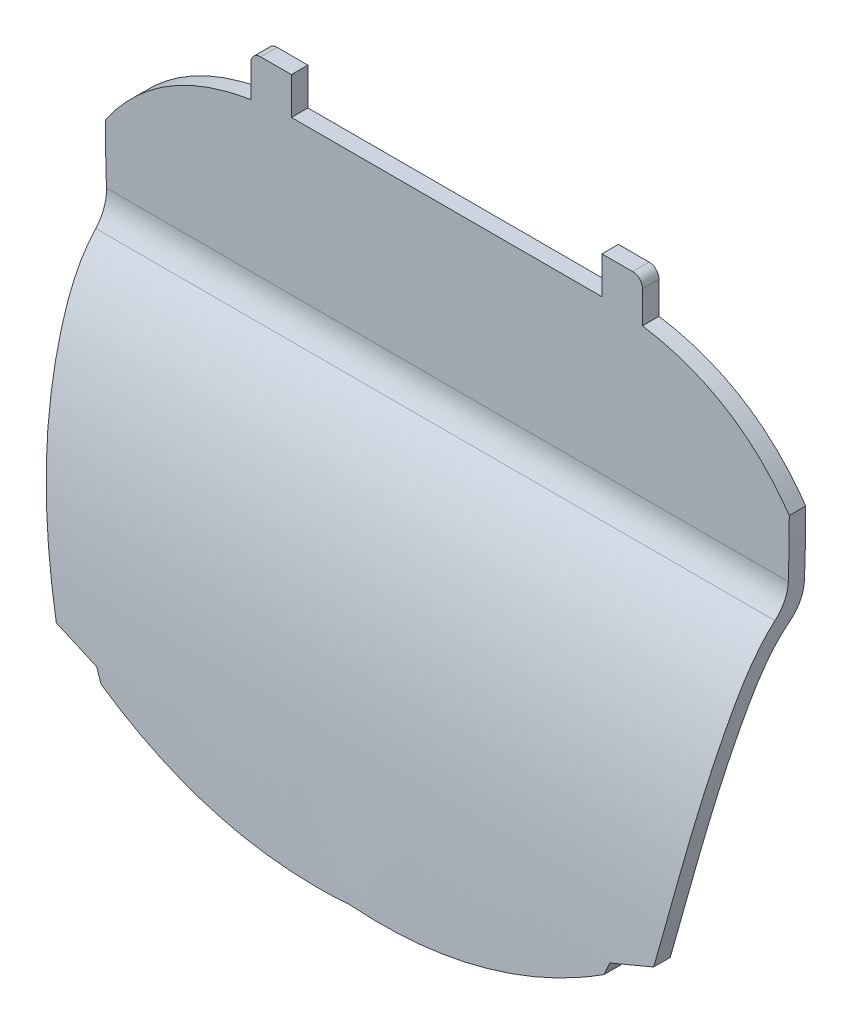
ISO-10303-21;
HEADER;
FILE_DESCRIPTION(('STEP AP214'),'2;1');
FILE_NAME('part.step','',(''),(''),'','','');
FILE_SCHEMA(('AUTOMOTIVE_DESIGN { 1 0 10303 214 1 1 1 1 }'));
ENDSEC;
DATA;
#1=APPLICATION_CONTEXT('core data for automotive mechanical design processes');
#2=APPLICATION_PROTOCOL_DEFINITION('international standard','automotive_design',2000,#1);
#3=PRODUCT_CONTEXT('',#1,'mechanical');
#4=PRODUCT('Part','Part','',(#3));
#5=PRODUCT_RELATED_PRODUCT_CATEGORY('part','',(#4));
#6=PRODUCT_DEFINITION_FORMATION('','',#4);
#7=PRODUCT_DEFINITION_CONTEXT('part definition',#1,'design');
#8=PRODUCT_DEFINITION('design','',#6,#7);
#9=PRODUCT_DEFINITION_SHAPE('','',#8);
#10=(LENGTH_UNIT() NAMED_UNIT(*) SI_UNIT(.MILLI.,.METRE.));
#11=(NAMED_UNIT(*) PLANE_ANGLE_UNIT() SI_UNIT($,.RADIAN.));
#12=(NAMED_UNIT(*) SI_UNIT($,.STERADIAN.) SOLID_ANGLE_UNIT());
#13=UNCERTAINTY_MEASURE_WITH_UNIT(LENGTH_MEASURE(1.E-05),#10,'distance_accuracy_value','');
#14=(GEOMETRIC_REPRESENTATION_CONTEXT(3) GLOBAL_UNCERTAINTY_ASSIGNED_CONTEXT((#13)) GLOBAL_UNIT_ASSIGNED_CONTEXT((#10,
#11,#12)) REPRESENTATION_CONTEXT('',''));
#15=CARTESIAN_POINT('',(0.,0.,0.));
#16=DIRECTION('',(0.,0.,1.));
#17=DIRECTION('',(1.,0.,0.));
#18=AXIS2_PLACEMENT_3D('',#15,#16,#17);
#19=CARTESIAN_POINT('',(-30.,27.662719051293,39.8154849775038));
#20=DIRECTION('',(1.,0.,0.));
#21=DIRECTION('',(0.,0.,-1.));
#22=AXIS2_PLACEMENT_3D('',#19,#20,#21);
#23=CYLINDRICAL_SURFACE('',#22,6.);
#24=DIRECTION('',(1.,0.,0.));
#25=VECTOR('',#24,1.);
#26=CARTESIAN_POINT('',(-90.,23.1462885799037,35.8655665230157));
#27=LINE('',#26,#25);
#28=CARTESIAN_POINT('',(-79.9980539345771,23.1462885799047,35.8655665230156));
#29=VERTEX_POINT('',#28);
#30=CARTESIAN_POINT('',(22.9656739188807,23.1462885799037,35.8655665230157));
#31=VERTEX_POINT('',#30);
#32=EDGE_CURVE('E453',#29,#31,#27,.T.);
#33=ORIENTED_EDGE('',*,*,#32,.F.);
#34=CARTESIAN_POINT('',(-79.9980539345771,23.1462885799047,35.8655665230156));
#35=CARTESIAN_POINT('',(-80.004673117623,23.2574492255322,35.7384355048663));
#36=CARTESIAN_POINT('',(-80.0115337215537,23.3739948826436,35.6160307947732));
#37=CARTESIAN_POINT('',(-80.0256410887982,23.6169668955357,35.3814865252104));
#38=CARTESIAN_POINT('',(-80.032887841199,23.7433929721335,35.2693466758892));
#39=CARTESIAN_POINT('',(-80.0476707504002,24.0052347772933,35.0561439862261));
#40=CARTESIAN_POINT('',(-80.0552068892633,24.1406499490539,34.9550804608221));
#41=CARTESIAN_POINT('',(-80.070471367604,24.4195052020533,34.7647368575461));
#42=CARTESIAN_POINT('',(-80.0781997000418,24.5629449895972,34.675456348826));
#43=CARTESIAN_POINT('',(-80.0937587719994,24.8569412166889,34.5092483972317));
#44=CARTESIAN_POINT('',(-80.1015895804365,25.0075026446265,34.4323297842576));
#45=CARTESIAN_POINT('',(-80.1172557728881,25.3145773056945,34.2914678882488));
#46=CARTESIAN_POINT('',(-80.1250911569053,25.4710905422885,34.2275246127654));
#47=CARTESIAN_POINT('',(-80.1406699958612,25.7887718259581,34.1131356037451));
#48=CARTESIAN_POINT('',(-80.1484135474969,25.9499342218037,34.0626741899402));
#49=CARTESIAN_POINT('',(-80.1637349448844,26.2758876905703,33.9755230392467));
#50=CARTESIAN_POINT('',(-80.1713128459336,26.4406775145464,33.9388286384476));
#51=CARTESIAN_POINT('',(-80.1866010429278,26.7809796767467,33.8779899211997));
#52=CARTESIAN_POINT('',(-80.1942994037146,26.9566197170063,33.8545546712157));
#53=CARTESIAN_POINT('',(-80.2093554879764,27.3090781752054,33.8233006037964));
#54=CARTESIAN_POINT('',(-80.2167136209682,27.4858948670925,33.8154625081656));
#55=CARTESIAN_POINT('',(-80.2238708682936,27.6627190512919,33.8154849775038));
#56=B_SPLINE_CURVE_WITH_KNOTS('',3,(#34,#35,#36,#37,#38,#39,#40,#41,#42,#43,#44,#45,#46,#47,#48,
#49,#50,#51,#52,#53,#54,#55),.UNSPECIFIED.,.F.,.F.,(4,2,2,2,2,2,2,2,2,2,4),(0.,
0.506860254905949,1.01370619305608,1.52052076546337,2.02731680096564,2.53447323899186,
3.04162997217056,3.54819425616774,4.05458677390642,4.5859808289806,5.11671766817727),.UNSPECIFIED.);
#57=CARTESIAN_POINT('',(-80.2238708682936,27.6627190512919,33.8154849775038));
#58=VERTEX_POINT('',#57);
#59=EDGE_CURVE('E466',#29,#58,#56,.T.);
#60=ORIENTED_EDGE('',*,*,#59,.T.);
#61=DIRECTION('',(1.,0.,0.));
#62=VECTOR('',#61,1.);
#63=CARTESIAN_POINT('',(-90.,27.662719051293,33.8154849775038));
#64=LINE('',#63,#62);
#65=CARTESIAN_POINT('',(23.1911437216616,27.6627190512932,33.8154849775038));
#66=VERTEX_POINT('',#65);
#67=EDGE_CURVE('E459',#66,#58,#64,.F.);
#68=ORIENTED_EDGE('',*,*,#67,.F.);
#69=CARTESIAN_POINT('',(23.1911437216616,27.6627190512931,33.8154849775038));
#70=CARTESIAN_POINT('',(23.1843268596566,27.4938413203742,33.8154669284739));
#71=CARTESIAN_POINT('',(23.177326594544,27.3249739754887,33.8226141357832));
#72=CARTESIAN_POINT('',(23.1630205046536,26.988458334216,33.8511051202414));
#73=CARTESIAN_POINT('',(23.1557146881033,26.8208100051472,33.8724485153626));
#74=CARTESIAN_POINT('',(23.1408587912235,26.4879309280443,33.9291963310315));
#75=CARTESIAN_POINT('',(23.1333087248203,26.3227000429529,33.964599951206));
#76=CARTESIAN_POINT('',(23.1180368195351,25.9958249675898,34.0492071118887));
#77=CARTESIAN_POINT('',(23.1103149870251,25.8341806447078,34.0984101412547));
#78=CARTESIAN_POINT('',(23.0947735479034,25.5155054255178,34.2103075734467));
#79=CARTESIAN_POINT('',(23.0869538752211,25.3584779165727,34.2730116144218));
#80=CARTESIAN_POINT('',(23.0713091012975,25.0502729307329,34.4114435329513));
#81=CARTESIAN_POINT('',(23.063484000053,24.8990954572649,34.4871714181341));
#82=CARTESIAN_POINT('',(23.047929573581,24.6038379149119,34.6510182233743));
#83=CARTESIAN_POINT('',(23.0402001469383,24.459749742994,34.739122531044));
#84=CARTESIAN_POINT('',(23.0249257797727,24.179551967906,34.9271306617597));
#85=CARTESIAN_POINT('',(23.0173807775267,24.0434396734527,35.0270304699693));
#86=CARTESIAN_POINT('',(23.0022062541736,23.7736495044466,35.2431295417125));
#87=CARTESIAN_POINT('',(22.99459072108,23.6404180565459,35.3598877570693));
#88=CARTESIAN_POINT('',(22.9797870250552,23.3849269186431,35.6045688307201));
#89=CARTESIAN_POINT('',(22.9725983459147,23.2626538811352,35.7324777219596));
#90=CARTESIAN_POINT('',(22.9656739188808,23.1462885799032,35.8655665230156));
#91=B_SPLINE_CURVE_WITH_KNOTS('',3,(#69,#70,#71,#72,#73,#74,#75,#76,#77,#78,#79,#80,#81,#82,#83,
#84,#85,#86,#87,#88,#89,#90),.UNSPECIFIED.,.F.,.F.,(4,2,2,2,2,2,2,2,2,2,4),(0.,
0.506890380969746,1.01376712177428,1.52061501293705,2.02744413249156,2.53463627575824,
3.04182871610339,3.54842728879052,4.05485392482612,4.58610620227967,5.11670235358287),.UNSPECIFIED.);
#92=EDGE_CURVE('E460',#66,#31,#91,.T.);
#93=ORIENTED_EDGE('',*,*,#92,.T.);
#94=EDGE_LOOP('',(#33,#60,#68,#93));
#95=FACE_BOUND('',#94,.T.);
#96=ADVANCED_FACE('F33',(#95),#23,.T.);
#97=CARTESIAN_POINT('',(-90.,-35.5113163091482,48.8154849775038));
#98=CARTESIAN_POINT('',(-90.,-19.0015524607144,47.699394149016));
#99=CARTESIAN_POINT('',(-90.,2.13267825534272,48.1491050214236));
#100=CARTESIAN_POINT('',(-90.,22.269267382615,37.9078235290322));
#101=CARTESIAN_POINT('',(-90.,24.6133448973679,33.8154849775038));
#102=B_SPLINE_CURVE_WITH_KNOTS('',3,(#97,#98,#99,#100,#101),.UNSPECIFIED.,.F.,.F.,(4,1,4),(0.,
0.779502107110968,1.),.UNSPECIFIED.);
#103=DIRECTION('',(1.,0.,0.));
#104=VECTOR('',#103,1.);
#105=SURFACE_OF_LINEAR_EXTRUSION('',#102,#104);
#106=CARTESIAN_POINT('',(-67.5578404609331,-20.7346473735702,47.9953086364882));
#107=CARTESIAN_POINT('',(-68.0822024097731,-20.5217949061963,47.9829987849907));
#108=CARTESIAN_POINT('',(-68.6065612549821,-20.3089436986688,47.9705339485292));
#109=CARTESIAN_POINT('',(-69.6552715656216,-19.8832442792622,47.9452592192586));
#110=CARTESIAN_POINT('',(-70.1796230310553,-19.6703960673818,47.9324493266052));
#111=CARTESIAN_POINT('',(-71.2283178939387,-19.2447029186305,47.9064493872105));
#112=CARTESIAN_POINT('',(-71.7526612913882,-19.0318579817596,47.8932593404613));
#113=CARTESIAN_POINT('',(-72.8013392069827,-18.6061717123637,47.8664638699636));
#114=CARTESIAN_POINT('',(-73.3256737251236,-18.3933303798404,47.8528584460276));
#115=CARTESIAN_POINT('',(-73.850003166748,-18.1804911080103,47.8390277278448));
#116=B_SPLINE_CURVE_WITH_KNOTS('',3,(#106,#107,#108,#109,#110,#111,#112,#113,#114,#115),
.UNSPECIFIED.,.F.,.F.,(4,2,2,2,4),(0.,1.69815148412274,3.3963022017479,5.09445295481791,
6.79260447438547),.UNSPECIFIED.);
#117=CARTESIAN_POINT('',(-67.5578404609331,-20.7346473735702,47.9953086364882));
#118=VERTEX_POINT('',#117);
#119=CARTESIAN_POINT('',(-73.850003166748,-18.1804911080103,47.8390277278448));
#120=VERTEX_POINT('',#119);
#121=EDGE_CURVE('E407',#118,#120,#116,.T.);
#122=ORIENTED_EDGE('',*,*,#121,.T.);
#123=CARTESIAN_POINT('',(-73.850003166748,-18.1804911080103,47.8390277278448));
#124=CARTESIAN_POINT('',(-74.0184681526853,-17.4776551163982,47.7933528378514));
#125=CARTESIAN_POINT('',(-74.1837361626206,-16.7742023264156,47.7451856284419));
#126=CARTESIAN_POINT('',(-74.5079407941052,-15.3658602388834,47.6425267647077));
#127=CARTESIAN_POINT('',(-74.6668736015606,-14.6609703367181,47.5880313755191));
#128=CARTESIAN_POINT('',(-74.9783189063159,-13.2501659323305,47.4714092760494));
#129=CARTESIAN_POINT('',(-75.1308293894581,-12.5442511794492,47.4092801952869));
#130=CARTESIAN_POINT('',(-75.4293452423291,-11.1318203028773,47.2760703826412));
#131=CARTESIAN_POINT('',(-75.5753500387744,-10.4253041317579,47.2049888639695));
#132=CARTESIAN_POINT('',(-75.8602554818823,-9.01467529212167,47.0528303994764));
#133=CARTESIAN_POINT('',(-75.9991805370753,-8.31056346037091,46.9717916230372));
#134=CARTESIAN_POINT('',(-76.270426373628,-6.90258526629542,46.7982104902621));
#135=CARTESIAN_POINT('',(-76.4027481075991,-6.19871888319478,46.7056697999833));
#136=CARTESIAN_POINT('',(-76.6607223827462,-4.79165475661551,46.5077904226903));
#137=CARTESIAN_POINT('',(-76.7863758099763,-4.08845693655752,46.4024534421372));
#138=CARTESIAN_POINT('',(-77.030969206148,-2.68314909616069,46.1777023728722));
#139=CARTESIAN_POINT('',(-77.1499093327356,-1.98103905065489,46.0582886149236));
#140=CARTESIAN_POINT('',(-77.3565250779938,-0.72723542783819,45.8311108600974));
#141=CARTESIAN_POINT('',(-77.4454809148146,-0.175226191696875,45.7262485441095));
#142=CARTESIAN_POINT('',(-77.6191913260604,0.927474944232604,45.5064448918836));
#143=CARTESIAN_POINT('',(-77.7039457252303,1.47816678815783,45.3915031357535));
#144=CARTESIAN_POINT('',(-77.8692390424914,2.57786217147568,45.150999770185));
#145=CARTESIAN_POINT('',(-77.9497779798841,3.12686571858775,45.0254382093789));
#146=CARTESIAN_POINT('',(-78.1066384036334,4.22282073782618,44.7631838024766));
#147=CARTESIAN_POINT('',(-78.1829598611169,4.76977219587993,44.6264908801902));
#148=CARTESIAN_POINT('',(-78.3317184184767,5.86364298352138,44.3408741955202));
#149=CARTESIAN_POINT('',(-78.4041367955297,6.41055141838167,44.1918988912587));
#150=CARTESIAN_POINT('',(-78.5447366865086,7.50147705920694,43.8818181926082));
#151=CARTESIAN_POINT('',(-78.6129181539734,8.04549423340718,43.7207126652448));
#152=CARTESIAN_POINT('',(-78.7450640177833,9.13016169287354,43.3860097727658));
#153=CARTESIAN_POINT('',(-78.8090286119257,9.67081213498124,43.2124129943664));
#154=CARTESIAN_POINT('',(-78.9327719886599,10.7482921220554,42.8524178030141));
#155=CARTESIAN_POINT('',(-78.9925509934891,11.2851218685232,42.6660200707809));
#156=CARTESIAN_POINT('',(-79.0876277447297,12.1660982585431,42.3481532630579));
#157=CARTESIAN_POINT('',(-79.1241295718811,12.5114859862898,42.2204727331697));
#158=CARTESIAN_POINT('',(-79.1775877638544,13.0281311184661,42.024812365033));
#159=CARTESIAN_POINT('',(-79.1951914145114,13.2001068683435,41.9589022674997));
#160=CARTESIAN_POINT('',(-79.2299687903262,13.5435615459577,41.825689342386));
#161=CARTESIAN_POINT('',(-79.2471425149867,13.7150404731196,41.7583865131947));
#162=CARTESIAN_POINT('',(-79.2980144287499,14.2286355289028,41.5540750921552));
#163=CARTESIAN_POINT('',(-79.3310595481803,14.5698731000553,41.4146774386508));
#164=CARTESIAN_POINT('',(-79.3953806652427,15.2493379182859,41.1278976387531));
#165=CARTESIAN_POINT('',(-79.4266558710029,15.5875637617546,40.9805119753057));
#166=CARTESIAN_POINT('',(-79.4871214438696,16.2570126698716,40.6775052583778));
#167=CARTESIAN_POINT('',(-79.5163273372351,16.588270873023,40.5219653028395));
#168=CARTESIAN_POINT('',(-79.5729013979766,17.2455512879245,40.199909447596));
#169=CARTESIAN_POINT('',(-79.6002697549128,17.5715740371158,40.0333946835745));
#170=CARTESIAN_POINT('',(-79.6531147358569,18.2168359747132,39.6878062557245));
#171=CARTESIAN_POINT('',(-79.6785924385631,18.5360789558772,39.5087398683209));
#172=CARTESIAN_POINT('',(-79.7276227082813,19.1661850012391,39.1363215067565));
#173=CARTESIAN_POINT('',(-79.7511759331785,19.4770509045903,38.9429744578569));
#174=CARTESIAN_POINT('',(-79.7888600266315,19.987382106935,38.6068487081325));
#175=CARTESIAN_POINT('',(-79.8035324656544,20.1897125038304,38.4684739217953));
#176=CARTESIAN_POINT('',(-79.8319844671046,20.5889934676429,38.1841028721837));
#177=CARTESIAN_POINT('',(-79.8457641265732,20.7859446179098,38.0381074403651));
#178=CARTESIAN_POINT('',(-79.8724149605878,21.1736180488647,37.738112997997));
#179=CARTESIAN_POINT('',(-79.8852864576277,21.364342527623,37.5841168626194));
#180=CARTESIAN_POINT('',(-79.910255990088,21.7408748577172,37.26593321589));
#181=CARTESIAN_POINT('',(-79.9223436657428,21.9266030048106,37.1016503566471));
#182=CARTESIAN_POINT('',(-79.9455809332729,22.2899774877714,36.7641359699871));
#183=CARTESIAN_POINT('',(-79.956730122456,22.4676203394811,36.5909006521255));
#184=CARTESIAN_POINT('',(-79.9780975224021,22.8139877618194,36.2351629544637));
#185=CARTESIAN_POINT('',(-79.9883142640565,22.9826980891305,36.0526466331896));
#186=CARTESIAN_POINT('',(-79.9980539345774,23.1462885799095,35.865566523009));
#187=B_SPLINE_CURVE_WITH_KNOTS('',3,(#123,#124,#125,#126,#127,#128,#129,#130,#131,#132,#133,
#134,#135,#136,#137,#138,#139,#140,#141,#142,#143,#144,#145,#146,#147,#148,#149,#150,#151,#152,
#153,#154,#155,#156,#157,#158,#159,#160,#161,#162,#163,#164,#165,#166,#167,#168,#169,#170,#171,
#172,#173,#174,#175,#176,#177,#178,#179,#180,#181,#182,#183,#184,#185,#186),.UNSPECIFIED.,.F.,
.F.,(4,2,2,2,2,2,2,2,2,2,2,2,2,2,2,2,2,2,2,2,2,2,2,2,2,2,2,2,2,2,2,4),(0.,2.17256408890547,
4.34641699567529,6.5209466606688,8.69566756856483,10.8622979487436,13.028614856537,
15.1946431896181,17.360620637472,19.0671610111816,20.7737725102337,22.4803761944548,
24.1869915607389,25.9011737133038,27.6153746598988,29.3294951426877,31.043524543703,
32.1535869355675,32.7086188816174,33.2636514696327,34.3738352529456,35.4845118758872,
36.5857013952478,37.6867771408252,38.787219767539,39.8872846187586,40.6238149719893,
41.3602651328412,42.0964524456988,42.8409421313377,43.585749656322,44.331711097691),.UNSPECIFIED.);
#188=EDGE_CURVE('E485',#120,#29,#187,.T.);
#189=ORIENTED_EDGE('',*,*,#188,.T.);
#190=ORIENTED_EDGE('',*,*,#32,.T.);
#191=CARTESIAN_POINT('',(22.9656739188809,23.1462885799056,35.8655665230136));
#192=CARTESIAN_POINT('',(22.9569281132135,22.9992947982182,36.0336610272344));
#193=CARTESIAN_POINT('',(22.9477970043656,22.8481659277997,36.1980793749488));
#194=CARTESIAN_POINT('',(22.9288067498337,22.5390434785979,36.518942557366));
#195=CARTESIAN_POINT('',(22.918950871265,22.3810818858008,36.6754183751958));
#196=CARTESIAN_POINT('',(22.898505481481,22.0588503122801,36.98081194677));
#197=CARTESIAN_POINT('',(22.8879179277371,21.8945976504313,37.1297481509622));
#198=CARTESIAN_POINT('',(22.8660060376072,21.5603184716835,37.4204869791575));
#199=CARTESIAN_POINT('',(22.8546826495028,21.3902995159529,37.5622983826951));
#200=CARTESIAN_POINT('',(22.8312975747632,21.0450043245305,37.8391868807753));
#201=CARTESIAN_POINT('',(22.819236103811,20.8697296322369,37.9742659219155));
#202=CARTESIAN_POINT('',(22.7945464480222,20.5168647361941,38.2362621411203));
#203=CARTESIAN_POINT('',(22.7819279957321,20.3393368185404,38.3632642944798));
#204=CARTESIAN_POINT('',(22.7559776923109,19.9801334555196,38.6114384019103));
#205=CARTESIAN_POINT('',(22.7426453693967,19.7984553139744,38.7326063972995));
#206=CARTESIAN_POINT('',(22.7152746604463,19.4314269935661,38.9694425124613));
#207=CARTESIAN_POINT('',(22.7012357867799,19.2460743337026,39.0851067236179));
#208=CARTESIAN_POINT('',(22.6724623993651,18.8721642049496,39.3112559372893));
#209=CARTESIAN_POINT('',(22.657727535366,18.6836051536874,39.42173827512));
#210=CARTESIAN_POINT('',(22.6275766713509,18.3037467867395,39.6378300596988));
#211=CARTESIAN_POINT('',(22.6121605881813,18.112447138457,39.7434389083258));
#212=CARTESIAN_POINT('',(22.5598896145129,17.4737040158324,40.0863942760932));
#213=CARTESIAN_POINT('',(22.5215644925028,17.0210577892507,40.3138659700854));
#214=CARTESIAN_POINT('',(22.4414197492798,16.1066901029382,40.7488894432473));
#215=CARTESIAN_POINT('',(22.3995999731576,15.6449682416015,40.9564403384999));
#216=CARTESIAN_POINT('',(22.3343095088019,14.9473939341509,41.2560765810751));
#217=CARTESIAN_POINT('',(22.312107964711,14.7139241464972,41.3540511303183));
#218=CARTESIAN_POINT('',(22.2668681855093,14.2456505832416,41.5465672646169));
#219=CARTESIAN_POINT('',(22.2438299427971,14.0108467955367,41.641108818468));
#220=CARTESIAN_POINT('',(22.1969121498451,13.5399789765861,41.8273797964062));
#221=CARTESIAN_POINT('',(22.1730318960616,13.3039140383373,41.9191067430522));
#222=CARTESIAN_POINT('',(22.1244558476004,12.8308850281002,42.0999860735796));
#223=CARTESIAN_POINT('',(22.0997600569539,12.5939209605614,42.1891384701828));
#224=CARTESIAN_POINT('',(22.0495371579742,12.1190263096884,42.3648640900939));
#225=CARTESIAN_POINT('',(22.0240097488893,11.8810954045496,42.4514363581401));
#226=CARTESIAN_POINT('',(21.972128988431,11.4044013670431,42.6219994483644));
#227=CARTESIAN_POINT('',(21.9457756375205,11.165638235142,42.7059902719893));
#228=CARTESIAN_POINT('',(21.8654809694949,10.4482481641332,42.9540852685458));
#229=CARTESIAN_POINT('',(21.8102949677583,9.96842527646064,43.1143471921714));
#230=CARTESIAN_POINT('',(21.6952924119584,8.99501104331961,43.4283397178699));
#231=CARTESIAN_POINT('',(21.6353991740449,8.5013544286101,43.5818394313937));
#232=CARTESIAN_POINT('',(21.5121569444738,7.51188924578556,43.878431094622));
#233=CARTESIAN_POINT('',(21.4488113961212,7.01608325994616,44.0215330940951));
#234=CARTESIAN_POINT('',(21.3186406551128,6.02251147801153,44.2976927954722));
#235=CARTESIAN_POINT('',(21.2518178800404,5.5247472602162,44.4307573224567));
#236=CARTESIAN_POINT('',(21.1146739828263,4.52745301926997,44.6872236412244));
#237=CARTESIAN_POINT('',(21.0443543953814,4.02792385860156,44.8106296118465));
#238=CARTESIAN_POINT('',(20.9002037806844,3.02729740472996,45.0481767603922));
#239=CARTESIAN_POINT('',(20.8263735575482,2.5262004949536,45.1623200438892));
#240=CARTESIAN_POINT('',(20.6751943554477,1.52263946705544,45.3817549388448));
#241=CARTESIAN_POINT('',(20.5978456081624,1.02017544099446,45.487047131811));
#242=CARTESIAN_POINT('',(20.4362156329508,-0.00761418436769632,45.6935666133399));
#243=CARTESIAN_POINT('',(20.3517792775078,-0.532990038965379,45.7944220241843));
#244=CARTESIAN_POINT('',(20.1790700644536,-1.5848427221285,45.9874773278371));
#245=CARTESIAN_POINT('',(20.0907962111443,-2.11131980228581,46.0796749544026));
#246=CARTESIAN_POINT('',(19.9104214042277,-3.1651484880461,46.2559252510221));
#247=CARTESIAN_POINT('',(19.8183192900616,-3.69250031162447,46.3399754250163));
#248=CARTESIAN_POINT('',(19.6303039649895,-4.74785102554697,46.5004525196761));
#249=CARTESIAN_POINT('',(19.5343896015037,-5.27585006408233,46.5768771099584));
#250=CARTESIAN_POINT('',(19.3387801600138,-6.33226897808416,46.7226343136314));
#251=CARTESIAN_POINT('',(19.2390841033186,-6.86068892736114,46.7919650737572));
#252=CARTESIAN_POINT('',(19.0359453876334,-7.91772316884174,46.9240732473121));
#253=CARTESIAN_POINT('',(18.9325020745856,-8.44633747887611,46.986849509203));
#254=CARTESIAN_POINT('',(18.7260591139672,-9.48268655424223,47.1040354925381));
#255=CARTESIAN_POINT('',(18.6232024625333,-9.99042365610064,47.1586773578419));
#256=CARTESIAN_POINT('',(18.4141041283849,-11.0056614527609,47.2629013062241));
#257=CARTESIAN_POINT('',(18.3078628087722,-11.5131621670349,47.3124839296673));
#258=CARTESIAN_POINT('',(18.0920351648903,-12.5277222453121,47.4070761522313));
#259=CARTESIAN_POINT('',(17.9824498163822,-13.0347816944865,47.4520870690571));
#260=CARTESIAN_POINT('',(17.7599769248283,-14.0482553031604,47.5380227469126));
#261=CARTESIAN_POINT('',(17.6470910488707,-14.5546696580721,47.5789495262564));
#262=CARTESIAN_POINT('',(17.4180629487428,-15.566649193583,47.657202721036));
#263=CARTESIAN_POINT('',(17.3019231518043,-16.0722147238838,47.6945317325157));
#264=CARTESIAN_POINT('',(17.066435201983,-17.0822958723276,47.7660711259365));
#265=CARTESIAN_POINT('',(16.9470902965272,-17.5868120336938,47.8002845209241));
#266=CARTESIAN_POINT('',(16.8260924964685,-18.0910131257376,47.8331999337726));
#267=B_SPLINE_CURVE_WITH_KNOTS('',3,(#191,#192,#193,#194,#195,#196,#197,#198,#199,#200,#201,
#202,#203,#204,#205,#206,#207,#208,#209,#210,#211,#212,#213,#214,#215,#216,#217,#218,#219,#220,
#221,#222,#223,#224,#225,#226,#227,#228,#229,#230,#231,#232,#233,#234,#235,#236,#237,#238,#239,
#240,#241,#242,#243,#244,#245,#246,#247,#248,#249,#250,#251,#252,#253,#254,#255,#256,#257,#258,
#259,#260,#261,#262,#263,#264,#265,#266),.UNSPECIFIED.,.F.,.F.,(4,2,2,2,2,2,2,2,2,2,2,2,2,2,2,2,
2,2,2,2,2,2,2,2,2,2,2,2,2,2,2,2,2,2,2,2,2,4),(0.,0.670301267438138,1.33774707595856,
2.00347164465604,2.66835467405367,3.33304433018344,3.98884745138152,4.64508946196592,
5.30179076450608,5.95882614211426,6.61594194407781,8.13935771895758,9.66284105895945,
10.4253139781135,11.1877938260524,11.9509266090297,12.7140556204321,13.4774637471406,
14.2408714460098,15.7673806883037,17.3285467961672,18.8881833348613,20.4467496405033,
22.00463785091,23.5621709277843,25.1196015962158,26.7442864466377,28.3693953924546,
29.9950006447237,31.6211011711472,33.2476254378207,34.8744349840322,36.4371703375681,
37.9997386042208,39.5618552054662,41.1231959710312,42.6834015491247,44.242081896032),.UNSPECIFIED.);
#268=CARTESIAN_POINT('',(16.8260924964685,-18.0910131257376,47.8331999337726));
#269=VERTEX_POINT('',#268);
#270=EDGE_CURVE('E271',#31,#269,#267,.T.);
#271=ORIENTED_EDGE('',*,*,#270,.T.);
#272=CARTESIAN_POINT('',(16.8260924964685,-18.0910131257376,47.8331999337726));
#273=CARTESIAN_POINT('',(16.2833954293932,-18.3113083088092,47.8475809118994));
#274=CARTESIAN_POINT('',(15.7406928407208,-18.5316057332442,47.8617178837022));
#275=CARTESIAN_POINT('',(14.6552780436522,-18.9722044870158,47.8895428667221));
#276=CARTESIAN_POINT('',(14.112565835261,-19.1925058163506,47.9032308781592));
#277=CARTESIAN_POINT('',(13.027132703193,-19.6331120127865,47.930197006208));
#278=CARTESIAN_POINT('',(12.4844117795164,-19.8534168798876,47.9434751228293));
#279=CARTESIAN_POINT('',(11.3989619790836,-20.2940298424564,47.969660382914));
#280=CARTESIAN_POINT('',(10.8562331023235,-20.5143379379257,47.9825675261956));
#281=CARTESIAN_POINT('',(10.3135009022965,-20.7346473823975,47.9953086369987));
#282=B_SPLINE_CURVE_WITH_KNOTS('',3,(#272,#273,#274,#275,#276,#277,#278,#279,#280,#281),
.UNSPECIFIED.,.F.,.F.,(4,2,2,2,4),(0.,1.75764377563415,3.51528669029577,5.27292956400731,
7.03057329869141),.UNSPECIFIED.);
#283=CARTESIAN_POINT('',(10.3135009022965,-20.7346473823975,47.9953086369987));
#284=VERTEX_POINT('',#283);
#285=EDGE_CURVE('E527',#269,#284,#282,.T.);
#286=ORIENTED_EDGE('',*,*,#285,.T.);
#287=CARTESIAN_POINT('',(10.3135009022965,-20.7346473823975,47.9953086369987));
#288=CARTESIAN_POINT('',(10.1879746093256,-21.0433843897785,48.0131282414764));
#289=CARTESIAN_POINT('',(10.0624430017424,-21.3521344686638,48.0306755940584));
#290=CARTESIAN_POINT('',(9.81136915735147,-21.969660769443,48.0652257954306));
#291=CARTESIAN_POINT('',(9.68582692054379,-22.2784369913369,48.0822286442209));
#292=CARTESIAN_POINT('',(9.56027936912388,-22.5872262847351,48.0989592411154));
#293=B_SPLINE_CURVE_WITH_KNOTS('',3,(#287,#288,#289,#290,#291,#292),.UNSPECIFIED.,.F.,.F.,(4,2,
4),(0.,1.00126637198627,2.00253274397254),.UNSPECIFIED.);
#294=CARTESIAN_POINT('',(9.56027936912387,-22.5872262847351,48.0989592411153));
#295=VERTEX_POINT('',#294);
#296=EDGE_CURVE('E391',#284,#295,#293,.T.);
#297=ORIENTED_EDGE('',*,*,#296,.T.);
#298=CARTESIAN_POINT('',(9.56027936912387,-22.5872262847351,48.0989592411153));
#299=CARTESIAN_POINT('',(9.31421799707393,-22.7417418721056,48.1073486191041));
#300=CARTESIAN_POINT('',(9.06720898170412,-22.894749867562,48.1156015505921));
#301=CARTESIAN_POINT('',(8.57131244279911,-23.197708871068,48.1318501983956));
#302=CARTESIAN_POINT('',(8.32242490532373,-23.3476598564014,48.1398459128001));
#303=CARTESIAN_POINT('',(7.57291727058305,-23.7928955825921,48.163472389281));
#304=CARTESIAN_POINT('',(7.06950920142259,-24.0835272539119,48.1787405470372));
#305=CARTESIAN_POINT('',(6.05531539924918,-24.6517075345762,48.2083962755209));
#306=CARTESIAN_POINT('',(5.54452937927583,-24.9292556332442,48.2227838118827));
#307=CARTESIAN_POINT('',(4.51590001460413,-25.470845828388,48.2507546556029));
#308=CARTESIAN_POINT('',(3.99805753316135,-25.7348895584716,48.2643380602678));
#309=CARTESIAN_POINT('',(2.95550333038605,-26.2490445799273,48.2907553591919));
#310=CARTESIAN_POINT('',(2.43079185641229,-26.4991563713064,48.3035892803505));
#311=CARTESIAN_POINT('',(1.37474285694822,-26.9850048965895,48.328541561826));
#312=CARTESIAN_POINT('',(0.843405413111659,-27.2207418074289,48.3406599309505));
#313=CARTESIAN_POINT('',(-0.209540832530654,-27.6705400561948,48.3638433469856));
#314=CARTESIAN_POINT('',(-0.730961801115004,-27.8850400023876,48.3749291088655));
#315=CARTESIAN_POINT('',(-1.77947032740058,-28.2997576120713,48.3964451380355));
#316=CARTESIAN_POINT('',(-2.30655790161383,-28.4999752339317,48.406875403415));
#317=CARTESIAN_POINT('',(-3.36604818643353,-28.8858178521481,48.4270725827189));
#318=CARTESIAN_POINT('',(-3.89845077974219,-29.0714431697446,48.4368395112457));
#319=CARTESIAN_POINT('',(-4.96825604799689,-29.4278607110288,48.4556953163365));
#320=CARTESIAN_POINT('',(-5.50565910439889,-29.5986517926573,48.4647841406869));
#321=CARTESIAN_POINT('',(-6.58505622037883,-29.9251590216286,48.482260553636));
#322=CARTESIAN_POINT('',(-7.1270504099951,-30.0808747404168,48.4906481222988));
#323=CARTESIAN_POINT('',(-8.21524845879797,-30.3770619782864,48.5066962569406));
#324=CARTESIAN_POINT('',(-8.76145272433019,-30.5175320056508,48.5143567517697));
#325=CARTESIAN_POINT('',(-10.095169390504,-30.8406147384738,48.5320776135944));
#326=CARTESIAN_POINT('',(-10.8846695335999,-31.0151072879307,48.5417391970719));
#327=CARTESIAN_POINT('',(-12.4703025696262,-31.332187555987,48.5594240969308));
#328=CARTESIAN_POINT('',(-13.2664374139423,-31.4747655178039,48.5674469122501));
#329=CARTESIAN_POINT('',(-14.8640186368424,-31.7280239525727,48.5817841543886));
#330=CARTESIAN_POINT('',(-15.6654665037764,-31.8386950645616,48.5880980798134));
#331=CARTESIAN_POINT('',(-17.2722695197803,-32.0284965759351,48.5989757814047));
#332=CARTESIAN_POINT('',(-18.0776255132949,-32.1076198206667,48.6035391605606));
#333=CARTESIAN_POINT('',(-19.6943675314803,-32.2348990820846,48.6109006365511));
#334=CARTESIAN_POINT('',(-20.5057645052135,-32.2829175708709,48.613690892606));
#335=CARTESIAN_POINT('',(-21.7236946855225,-32.331482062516,48.6165159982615));
#336=CARTESIAN_POINT('',(-22.1297927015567,-32.3437596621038,48.6172309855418));
#337=CARTESIAN_POINT('',(-22.9421545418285,-32.3606029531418,48.6182121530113));
#338=CARTESIAN_POINT('',(-23.3484183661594,-32.3651686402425,48.6184783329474));
#339=CARTESIAN_POINT('',(-24.1607975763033,-32.3667404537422,48.6185699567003));
#340=CARTESIAN_POINT('',(-24.5669129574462,-32.3637495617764,48.6183955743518));
#341=CARTESIAN_POINT('',(-25.3790236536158,-32.3504284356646,48.6176194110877));
#342=CARTESIAN_POINT('',(-25.7850189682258,-32.3400981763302,48.6170176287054));
#343=CARTESIAN_POINT('',(-26.5964401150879,-32.3122222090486,48.615395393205));
#344=CARTESIAN_POINT('',(-27.0018661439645,-32.2946821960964,48.6143752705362));
#345=CARTESIAN_POINT('',(-27.8123354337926,-32.252404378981,48.6119202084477));
#346=CARTESIAN_POINT('',(-28.2173787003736,-32.2276666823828,48.6104852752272));
#347=CARTESIAN_POINT('',(-28.6221698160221,-32.1993385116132,48.6088448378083));
#348=B_SPLINE_CURVE_WITH_KNOTS('',3,(#298,#299,#300,#301,#302,#303,#304,#305,#306,#307,#308,
#309,#310,#311,#312,#313,#314,#315,#316,#317,#318,#319,#320,#321,#322,#323,#324,#325,#326,#327,
#328,#329,#330,#331,#332,#333,#334,#335,#336,#337,#338,#339,#340,#341,#342,#343,#344,#345,#346,
#347),.UNSPECIFIED.,.F.,.F.,(4,2,2,2,2,2,2,2,2,2,2,2,2,2,2,2,2,2,2,2,2,2,2,2,4),(0.,
0.872011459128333,1.744029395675,3.48826741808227,5.23257346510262,6.9766680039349,
8.72069990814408,10.4647103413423,12.1562834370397,13.8478614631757,15.5394022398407,
17.2310731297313,18.9227920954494,20.6146764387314,23.0398133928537,25.4656907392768,
27.8922790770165,30.3194174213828,32.7572152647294,33.9760072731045,35.1947999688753,
36.4131118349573,37.6314278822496,38.848783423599,40.0661207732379),.UNSPECIFIED.);
#349=CARTESIAN_POINT('',(-28.6221698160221,-32.1993385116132,48.6088448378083));
#350=VERTEX_POINT('',#349);
#351=EDGE_CURVE('E383',#295,#350,#348,.T.);
#352=ORIENTED_EDGE('',*,*,#351,.T.);
#353=CARTESIAN_POINT('',(-28.6221698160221,-32.1993385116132,48.6088448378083));
#354=CARTESIAN_POINT('',(-28.9121499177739,-32.2205556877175,48.6100733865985));
#355=CARTESIAN_POINT('',(-29.2022607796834,-32.2399467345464,48.6111976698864));
#356=CARTESIAN_POINT('',(-29.7827080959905,-32.2750468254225,48.6132346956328));
#357=CARTESIAN_POINT('',(-30.0730445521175,-32.2907558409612,48.6141474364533));
#358=CARTESIAN_POINT('',(-30.944401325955,-32.3323180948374,48.6165639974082));
#359=CARTESIAN_POINT('',(-31.5256994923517,-32.3526014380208,48.6177458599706));
#360=CARTESIAN_POINT('',(-32.6886507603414,-32.3777498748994,48.619211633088));
#361=CARTESIAN_POINT('',(-33.2703038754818,-32.3826143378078,48.6194955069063));
#362=CARTESIAN_POINT('',(-34.433331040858,-32.3767111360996,48.6191512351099));
#363=CARTESIAN_POINT('',(-35.0147051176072,-32.3659489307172,48.6185234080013));
#364=CARTESIAN_POINT('',(-36.1769188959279,-32.3285176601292,48.616343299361));
#365=CARTESIAN_POINT('',(-36.7577586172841,-32.3018492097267,48.6147910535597));
#366=CARTESIAN_POINT('',(-37.9184601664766,-32.2323425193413,48.6107556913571));
#367=CARTESIAN_POINT('',(-38.4983220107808,-32.1895045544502,48.6082725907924));
#368=CARTESIAN_POINT('',(-39.6296189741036,-32.089804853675,48.6025135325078));
#369=CARTESIAN_POINT('',(-40.1811201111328,-32.0336892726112,48.5992798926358));
#370=CARTESIAN_POINT('',(-41.2823806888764,-31.9064133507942,48.5919754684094));
#371=CARTESIAN_POINT('',(-41.8321401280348,-31.8352529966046,48.5879046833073));
#372=CARTESIAN_POINT('',(-42.9294709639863,-31.6778093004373,48.578940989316));
#373=CARTESIAN_POINT('',(-43.4770424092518,-31.5915262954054,48.5740480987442));
#374=CARTESIAN_POINT('',(-44.5696765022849,-31.4037898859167,48.5634594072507));
#375=CARTESIAN_POINT('',(-45.1147386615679,-31.3023336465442,48.5577634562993));
#376=CARTESIAN_POINT('',(-46.2018302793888,-31.0842554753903,48.5455921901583));
#377=CARTESIAN_POINT('',(-46.7438596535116,-30.9676331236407,48.539116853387));
#378=CARTESIAN_POINT('',(-47.8244806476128,-30.7192716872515,48.5254126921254));
#379=CARTESIAN_POINT('',(-48.363071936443,-30.5875311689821,48.5181837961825));
#380=CARTESIAN_POINT('',(-49.6896977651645,-30.2433031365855,48.4994164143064));
#381=CARTESIAN_POINT('',(-50.4754705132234,-30.0220543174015,48.4874543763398));
#382=CARTESIAN_POINT('',(-52.0375068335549,-29.547488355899,48.4620388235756));
#383=CARTESIAN_POINT('',(-52.8137672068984,-29.294160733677,48.4485848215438));
#384=CARTESIAN_POINT('',(-54.3556008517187,-28.7561526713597,48.420251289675));
#385=CARTESIAN_POINT('',(-55.1211705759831,-28.4714620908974,48.4053712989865));
#386=CARTESIAN_POINT('',(-56.6404704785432,-27.8715976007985,48.3742179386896));
#387=CARTESIAN_POINT('',(-57.3941974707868,-27.5564156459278,48.357944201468));
#388=CARTESIAN_POINT('',(-58.8918171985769,-26.8953595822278,48.3239245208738));
#389=CARTESIAN_POINT('',(-59.6356551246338,-26.5493617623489,48.3061726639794));
#390=CARTESIAN_POINT('',(-61.1093872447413,-25.8291534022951,48.2691884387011));
#391=CARTESIAN_POINT('',(-61.8392834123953,-25.4549468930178,48.2499562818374));
#392=CARTESIAN_POINT('',(-62.9230339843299,-24.8735295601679,48.2198876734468));
#393=CARTESIAN_POINT('',(-63.2823607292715,-24.6764161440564,48.2096636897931));
#394=CARTESIAN_POINT('',(-63.9973050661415,-24.2755816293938,48.188777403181));
#395=CARTESIAN_POINT('',(-64.352922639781,-24.0718604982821,48.1781150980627));
#396=CARTESIAN_POINT('',(-65.0600911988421,-23.6582304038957,48.1563337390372));
#397=CARTESIAN_POINT('',(-65.4116455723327,-23.4483272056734,48.1452151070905));
#398=CARTESIAN_POINT('',(-66.1109743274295,-23.0223541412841,48.1224743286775));
#399=CARTESIAN_POINT('',(-66.4587487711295,-22.8062843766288,48.110852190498));
#400=CARTESIAN_POINT('',(-66.8046189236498,-22.5872262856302,48.0989592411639));
#401=B_SPLINE_CURVE_WITH_KNOTS('',3,(#353,#354,#355,#356,#357,#358,#359,#360,#361,#362,#363,
#364,#365,#366,#367,#368,#369,#370,#371,#372,#373,#374,#375,#376,#377,#378,#379,#380,#381,#382,
#383,#384,#385,#386,#387,#388,#389,#390,#391,#392,#393,#394,#395,#396,#397,#398,#399,#400),
.UNSPECIFIED.,.F.,.F.,(4,2,2,2,2,2,2,2,2,2,2,2,2,2,2,2,2,2,2,2,2,2,2,4),(0.,0.872261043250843,
1.74452883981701,3.48927360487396,5.23408974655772,6.97829647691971,8.72243579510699,
10.4665454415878,12.1294161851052,13.7922884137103,15.455123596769,17.1182698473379,
18.7814621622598,20.4448123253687,22.8933246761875,25.3426390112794,27.7927476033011,
30.2435044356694,32.704586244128,35.1653170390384,36.395164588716,37.6250181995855,
38.8537591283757,40.0824798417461),.UNSPECIFIED.);
#402=CARTESIAN_POINT('',(-66.8046189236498,-22.5872262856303,48.0989592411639));
#403=VERTEX_POINT('',#402);
#404=EDGE_CURVE('E390',#350,#403,#401,.T.);
#405=ORIENTED_EDGE('',*,*,#404,.T.);
#406=CARTESIAN_POINT('',(-66.8046189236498,-22.5872262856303,48.0989592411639));
#407=CARTESIAN_POINT('',(-66.9301664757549,-22.2784369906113,48.0822286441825));
#408=CARTESIAN_POINT('',(-67.0557087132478,-21.9696607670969,48.065225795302));
#409=CARTESIAN_POINT('',(-67.3067825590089,-21.3521344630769,48.0306755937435));
#410=CARTESIAN_POINT('',(-67.4323141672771,-21.0433843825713,48.0131282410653));
#411=CARTESIAN_POINT('',(-67.5578404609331,-20.7346473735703,47.9953086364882));
#412=B_SPLINE_CURVE_WITH_KNOTS('',3,(#406,#407,#408,#409,#410,#411),.UNSPECIFIED.,.F.,.F.,(4,2,
4),(0.,1.00126637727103,2.00253275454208),.UNSPECIFIED.);
#413=EDGE_CURVE('E401',#403,#118,#412,.T.);
#414=ORIENTED_EDGE('',*,*,#413,.T.);
#415=EDGE_LOOP('',(#122,#189,#190,#271,#286,#297,#352,#405,#414));
#416=FACE_BOUND('',#415,.T.);
#417=ADVANCED_FACE('F322',(#416),#105,.T.);
#418=CARTESIAN_POINT('',(-90.,24.6133448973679,33.8154849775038));
#419=DIRECTION('',(0.,0.,-1.));
#420=DIRECTION('',(-1.,0.,0.));
#421=AXIS2_PLACEMENT_3D('',#418,#419,#420);
#422=PLANE('',#421);
#423=ORIENTED_EDGE('',*,*,#67,.T.);
#424=CARTESIAN_POINT('',(-73.850003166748,-18.1804911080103,33.8154849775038));
#425=CARTESIAN_POINT('',(-74.9474206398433,-13.6020712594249,33.8154849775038));
#426=CARTESIAN_POINT('',(-76.8781552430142,-4.36257689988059,33.8154849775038));
#427=CARTESIAN_POINT('',(-78.9332717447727,9.54464365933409,33.8154849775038));
#428=CARTESIAN_POINT('',(-80.1610919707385,23.5437378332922,33.8154849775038));
#429=CARTESIAN_POINT('',(-80.4257129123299,32.9613003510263,33.8154849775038));
#430=CARTESIAN_POINT('',(-80.4197395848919,37.6622680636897,33.8154849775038));
#431=B_SPLINE_CURVE_WITH_KNOTS('',3,(#424,#425,#426,#427,#428,#429,#430),.UNSPECIFIED.,.F.,.F.,
(4,1,1,1,4),(0.499305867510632,0.499630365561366,0.499954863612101,0.500279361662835,
0.50060385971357),.UNSPECIFIED.);
#432=CARTESIAN_POINT('',(-80.4197395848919,37.6622680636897,33.8154849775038));
#433=VERTEX_POINT('',#432);
#434=EDGE_CURVE('E242',#58,#433,#431,.T.);
#435=ORIENTED_EDGE('',*,*,#434,.T.);
#436=CARTESIAN_POINT('',(-80.4197395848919,37.6622680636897,33.8154849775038));
#437=CARTESIAN_POINT('',(-80.0904441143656,38.1373122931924,33.8154849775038));
#438=CARTESIAN_POINT('',(-79.4045733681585,39.0790547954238,33.8154849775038));
#439=CARTESIAN_POINT('',(-77.9859668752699,40.8409017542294,33.8154849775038));
#440=CARTESIAN_POINT('',(-76.0962502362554,42.8590983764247,33.8154849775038));
#441=CARTESIAN_POINT('',(-73.6484694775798,44.9827018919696,33.8154849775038));
#442=CARTESIAN_POINT('',(-71.0119575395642,46.8203015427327,33.8154849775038));
#443=CARTESIAN_POINT('',(-68.1779187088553,48.3775941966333,33.8154849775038));
#444=CARTESIAN_POINT('',(-65.13711288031,49.6578758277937,33.8154849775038));
#445=CARTESIAN_POINT('',(-62.4184068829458,50.4943490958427,33.8154849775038));
#446=CARTESIAN_POINT('',(-60.1378676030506,51.0222418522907,33.8154849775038));
#447=CARTESIAN_POINT('',(-58.9461816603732,51.2412420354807,33.8154849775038));
#448=CARTESIAN_POINT('',(-58.3533942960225,51.3368217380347,33.8154849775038));
#449=B_SPLINE_CURVE_WITH_KNOTS('',3,(#436,#437,#438,#439,#440,#441,#442,#443,#444,#445,#446,
#447,#448),.UNSPECIFIED.,.F.,.F.,(4,1,1,1,1,1,1,1,1,1,4),(0.499230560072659,0.499337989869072,
0.499445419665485,0.49966027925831,0.499875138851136,0.500089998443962,0.500304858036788,
0.500519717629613,0.500734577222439,0.500842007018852,0.500949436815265),.UNSPECIFIED.);
#450=CARTESIAN_POINT('',(-58.3533942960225,51.3368217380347,33.8154849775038));
#451=VERTEX_POINT('',#450);
#452=EDGE_CURVE('E250',#433,#451,#449,.T.);
#453=ORIENTED_EDGE('',*,*,#452,.T.);
#454=DIRECTION('',(0.,1.,0.));
#455=VECTOR('',#454,1.);
#456=CARTESIAN_POINT('',(-58.3533942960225,51.3368217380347,33.8154849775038));
#457=LINE('',#456,#455);
#458=CARTESIAN_POINT('',(-58.3533942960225,56.2070608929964,33.8154849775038));
#459=VERTEX_POINT('',#458);
#460=EDGE_CURVE('E258',#451,#459,#457,.T.);
#461=ORIENTED_EDGE('',*,*,#460,.T.);
#462=CARTESIAN_POINT('',(-56.8533942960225,56.2070608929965,33.8154849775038));
#463=DIRECTION('',(0.,0.,-1.));
#464=DIRECTION('',(-1.,0.,0.));
#465=AXIS2_PLACEMENT_3D('',#462,#463,#464);
#466=CIRCLE('',#465,1.49999999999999);
#467=CARTESIAN_POINT('',(-56.8533942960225,57.7070608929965,33.8154849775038));
#468=VERTEX_POINT('',#467);
#469=EDGE_CURVE('E264',#459,#468,#466,.T.);
#470=ORIENTED_EDGE('',*,*,#469,.T.);
#471=DIRECTION('',(1.,0.,0.));
#472=VECTOR('',#471,1.);
#473=CARTESIAN_POINT('',(-56.8533942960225,57.7070608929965,33.8154849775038));
#474=LINE('',#473,#472);
#475=CARTESIAN_POINT('',(-52.186235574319,57.7070608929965,33.8154849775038));
#476=VERTEX_POINT('',#475);
#477=EDGE_CURVE('E267',#468,#476,#474,.T.);
#478=ORIENTED_EDGE('',*,*,#477,.T.);
#479=DIRECTION('',(0.,-1.,0.));
#480=VECTOR('',#479,1.);
#481=CARTESIAN_POINT('',(-52.186235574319,57.7070608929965,33.8154849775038));
#482=LINE('',#481,#480);
#483=CARTESIAN_POINT('',(-52.186235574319,52.0736240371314,33.8154849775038));
#484=VERTEX_POINT('',#483);
#485=EDGE_CURVE('E217',#476,#484,#482,.T.);
#486=ORIENTED_EDGE('',*,*,#485,.T.);
#487=DIRECTION('',(1.,0.,0.));
#488=VECTOR('',#487,1.);
#489=CARTESIAN_POINT('',(-52.186235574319,52.0736240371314,33.8154849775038));
#490=LINE('',#489,#488);
#491=CARTESIAN_POINT('',(-5.05810410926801,52.0736240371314,33.8154849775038));
#492=VERTEX_POINT('',#491);
#493=EDGE_CURVE('E195',#484,#492,#490,.T.);
#494=ORIENTED_EDGE('',*,*,#493,.T.);
#495=DIRECTION('',(0.,1.,0.));
#496=VECTOR('',#495,1.);
#497=CARTESIAN_POINT('',(-5.05810410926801,52.0736240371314,33.8154849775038));
#498=LINE('',#497,#496);
#499=CARTESIAN_POINT('',(-5.05810410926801,57.7070608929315,33.8154849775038));
#500=VERTEX_POINT('',#499);
#501=EDGE_CURVE('E205',#492,#500,#498,.T.);
#502=ORIENTED_EDGE('',*,*,#501,.T.);
#503=DIRECTION('',(1.,0.,0.));
#504=VECTOR('',#503,1.);
#505=CARTESIAN_POINT('',(-5.05810410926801,57.7070608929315,33.8154849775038));
#506=LINE('',#505,#504);
#507=CARTESIAN_POINT('',(-0.390945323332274,57.7070608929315,33.8154849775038));
#508=VERTEX_POINT('',#507);
#509=EDGE_CURVE('E211',#500,#508,#506,.T.);
#510=ORIENTED_EDGE('',*,*,#509,.T.);
#511=CARTESIAN_POINT('',(-0.390945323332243,56.2070608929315,33.8154849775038));
#512=DIRECTION('',(0.,0.,-1.));
#513=DIRECTION('',(-1.,0.,0.));
#514=AXIS2_PLACEMENT_3D('',#511,#512,#513);
#515=CIRCLE('',#514,1.5);
#516=CARTESIAN_POINT('',(1.10905467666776,56.2070608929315,33.8154849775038));
#517=VERTEX_POINT('',#516);
#518=EDGE_CURVE('E223',#508,#517,#515,.T.);
#519=ORIENTED_EDGE('',*,*,#518,.T.);
#520=DIRECTION('',(0.,-1.,0.));
#521=VECTOR('',#520,1.);
#522=CARTESIAN_POINT('',(1.10905467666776,56.2070608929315,33.8154849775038));
#523=LINE('',#522,#521);
#524=CARTESIAN_POINT('',(1.10905467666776,51.3368217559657,33.8154849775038));
#525=VERTEX_POINT('',#524);
#526=EDGE_CURVE('E226',#517,#525,#523,.T.);
#527=ORIENTED_EDGE('',*,*,#526,.T.);
#528=CARTESIAN_POINT('',(1.10905467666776,51.3368217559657,33.8154849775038));
#529=CARTESIAN_POINT('',(1.70747942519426,51.2403330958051,33.8154849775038));
#530=CARTESIAN_POINT('',(2.91049825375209,51.0192502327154,33.8154849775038));
#531=CARTESIAN_POINT('',(5.21272537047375,50.4863372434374,33.8154849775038));
#532=CARTESIAN_POINT('',(7.95728615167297,49.6419091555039,33.8154849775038));
#533=CARTESIAN_POINT('',(11.0270099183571,48.3494521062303,33.8154849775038));
#534=CARTESIAN_POINT('',(13.8880003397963,46.7773496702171,33.8154849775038));
#535=CARTESIAN_POINT('',(16.5495853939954,44.9222745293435,33.8154849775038));
#536=CARTESIAN_POINT('',(19.0206444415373,42.7784756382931,33.8154849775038));
#537=CARTESIAN_POINT('',(20.9283322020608,40.7410860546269,33.8154849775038));
#538=CARTESIAN_POINT('',(22.3604295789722,38.9624840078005,33.8154849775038));
#539=CARTESIAN_POINT('',(23.0528229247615,38.0117855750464,33.8154849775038));
#540=CARTESIAN_POINT('',(23.3852499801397,37.5322236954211,33.8154849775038));
#541=B_SPLINE_CURVE_WITH_KNOTS('',3,(#528,#529,#530,#531,#532,#533,#534,#535,#536,#537,#538,
#539,#540),.UNSPECIFIED.,.F.,.F.,(4,1,1,1,1,1,1,1,1,1,4),(0.49905056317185,0.499157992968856,
0.499265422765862,0.499480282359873,0.499695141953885,0.499910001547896,0.500124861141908,
0.500339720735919,0.50055458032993,0.500662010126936,0.500769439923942),.UNSPECIFIED.);
#542=CARTESIAN_POINT('',(23.3852499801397,37.5322236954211,33.8154849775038));
#543=VERTEX_POINT('',#542);
#544=EDGE_CURVE('E229',#525,#543,#541,.T.);
#545=ORIENTED_EDGE('',*,*,#544,.T.);
#546=CARTESIAN_POINT('',(23.3852499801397,37.5322236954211,33.8154849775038));
#547=CARTESIAN_POINT('',(23.3899339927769,32.8495853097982,33.8154849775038));
#548=CARTESIAN_POINT('',(23.1238086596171,23.4688168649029,33.8154849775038));
#549=CARTESIAN_POINT('',(21.8970060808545,9.52464137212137,33.8154849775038));
#550=CARTESIAN_POINT('',(19.8461579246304,-4.32779595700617,33.8154849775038));
#551=CARTESIAN_POINT('',(17.9204637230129,-13.5307418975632,33.8154849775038));
#552=CARTESIAN_POINT('',(16.8260924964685,-18.0910131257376,33.8154849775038));
#553=B_SPLINE_CURVE_WITH_KNOTS('',3,(#546,#547,#548,#549,#550,#551,#552),.UNSPECIFIED.,.F.,.F.,
(4,1,1,1,4),(0.499396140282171,0.499720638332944,0.500045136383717,0.50036963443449,
0.500694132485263),.UNSPECIFIED.);
#554=EDGE_CURVE('E234',#543,#66,#553,.T.);
#555=ORIENTED_EDGE('',*,*,#554,.T.);
#556=EDGE_LOOP('',(#423,#435,#453,#461,#470,#478,#486,#494,#502,#510,#519,#527,#545,#555));
#557=FACE_BOUND('',#556,.T.);
#558=ADVANCED_FACE('F214',(#557),#422,.T.);
#559=CARTESIAN_POINT('',(-52.186235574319,57.7070608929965,51.3097919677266));
#560=DIRECTION('',(1.,0.,0.));
#561=DIRECTION('',(0.,0.,-1.));
#562=AXIS2_PLACEMENT_3D('',#559,#560,#561);
#563=PLANE('',#562);
#564=DIRECTION('',(0.,0.,-1.));
#565=VECTOR('',#564,1.);
#566=CARTESIAN_POINT('',(-52.186235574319,52.0736240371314,51.3097919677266));
#567=LINE('',#566,#565);
#568=CARTESIAN_POINT('',(-52.186235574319,52.0736240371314,36.3154849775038));
#569=VERTEX_POINT('',#568);
#570=EDGE_CURVE('E202',#569,#484,#567,.T.);
#571=ORIENTED_EDGE('',*,*,#570,.T.);
#572=ORIENTED_EDGE('',*,*,#485,.F.);
#573=DIRECTION('',(0.,0.,-1.));
#574=VECTOR('',#573,1.);
#575=CARTESIAN_POINT('',(-52.186235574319,57.7070608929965,51.3097919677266));
#576=LINE('',#575,#574);
#577=CARTESIAN_POINT('',(-52.186235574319,57.7070608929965,36.3154849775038));
#578=VERTEX_POINT('',#577);
#579=EDGE_CURVE('E269',#578,#476,#576,.T.);
#580=ORIENTED_EDGE('',*,*,#579,.F.);
#581=DIRECTION('',(0.,1.,0.));
#582=VECTOR('',#581,1.);
#583=CARTESIAN_POINT('',(-52.186235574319,25.9756566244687,36.3154849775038));
#584=LINE('',#583,#582);
#585=EDGE_CURVE('E566',#569,#578,#584,.T.);
#586=ORIENTED_EDGE('',*,*,#585,.F.);
#587=EDGE_LOOP('',(#571,#572,#580,#586));
#588=FACE_BOUND('',#587,.T.);
#589=ADVANCED_FACE('F636',(#588),#563,.T.);
#590=CARTESIAN_POINT('',(-56.8533942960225,57.7070608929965,51.3097919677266));
#591=DIRECTION('',(0.,1.,0.));
#592=DIRECTION('',(0.,0.,1.));
#593=AXIS2_PLACEMENT_3D('',#590,#591,#592);
#594=PLANE('',#593);
#595=ORIENTED_EDGE('',*,*,#579,.T.);
#596=ORIENTED_EDGE('',*,*,#477,.F.);
#597=DIRECTION('',(0.,0.,-1.));
#598=VECTOR('',#597,1.);
#599=CARTESIAN_POINT('',(-56.8533942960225,57.7070608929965,51.3097919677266));
#600=LINE('',#599,#598);
#601=CARTESIAN_POINT('',(-56.8533942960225,57.7070608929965,36.3154849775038));
#602=VERTEX_POINT('',#601);
#603=EDGE_CURVE('E272',#602,#468,#600,.T.);
#604=ORIENTED_EDGE('',*,*,#603,.F.);
#605=DIRECTION('',(-1.,0.,0.));
#606=VECTOR('',#605,1.);
#607=CARTESIAN_POINT('',(-90.,57.7070608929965,36.3154849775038));
#608=LINE('',#607,#606);
#609=EDGE_CURVE('E563',#578,#602,#608,.T.);
#610=ORIENTED_EDGE('',*,*,#609,.F.);
#611=EDGE_LOOP('',(#595,#596,#604,#610));
#612=FACE_BOUND('',#611,.T.);
#613=ADVANCED_FACE('F633',(#612),#594,.T.);
#614=CARTESIAN_POINT('',(-56.8533942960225,56.2070608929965,51.3097919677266));
#615=DIRECTION('',(0.,0.,-1.));
#616=DIRECTION('',(-1.,0.,0.));
#617=AXIS2_PLACEMENT_3D('',#614,#615,#616);
#618=CYLINDRICAL_SURFACE('',#617,1.49999999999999);
#619=ORIENTED_EDGE('',*,*,#603,.T.);
#620=ORIENTED_EDGE('',*,*,#469,.F.);
#621=DIRECTION('',(0.,0.,-1.));
#622=VECTOR('',#621,1.);
#623=CARTESIAN_POINT('',(-58.3533942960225,56.2070608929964,51.3097919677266));
#624=LINE('',#623,#622);
#625=CARTESIAN_POINT('',(-58.3533942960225,56.2070608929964,36.3154849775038));
#626=VERTEX_POINT('',#625);
#627=EDGE_CURVE('E274',#626,#459,#624,.T.);
#628=ORIENTED_EDGE('',*,*,#627,.F.);
#629=CARTESIAN_POINT('',(-56.8533942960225,56.2070608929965,36.3154849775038));
#630=DIRECTION('',(0.,0.,1.));
#631=DIRECTION('',(1.,0.,0.));
#632=AXIS2_PLACEMENT_3D('',#629,#630,#631);
#633=CIRCLE('',#632,1.49999999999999);
#634=EDGE_CURVE('E560',#602,#626,#633,.T.);
#635=ORIENTED_EDGE('',*,*,#634,.F.);
#636=EDGE_LOOP('',(#619,#620,#628,#635));
#637=FACE_BOUND('',#636,.T.);
#638=ADVANCED_FACE('F630',(#637),#618,.T.);
#639=CARTESIAN_POINT('',(-58.3533942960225,51.3368217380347,51.3097919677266));
#640=DIRECTION('',(-1.,0.,0.));
#641=DIRECTION('',(0.,0.,1.));
#642=AXIS2_PLACEMENT_3D('',#639,#640,#641);
#643=PLANE('',#642);
#644=ORIENTED_EDGE('',*,*,#627,.T.);
#645=ORIENTED_EDGE('',*,*,#460,.F.);
#646=DIRECTION('',(0.,0.,-1.));
#647=VECTOR('',#646,1.);
#648=CARTESIAN_POINT('',(-58.3533942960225,51.3368217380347,51.3097919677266));
#649=LINE('',#648,#647);
#650=CARTESIAN_POINT('',(-58.3533942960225,51.3368217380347,36.3154849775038));
#651=VERTEX_POINT('',#650);
#652=EDGE_CURVE('E276',#651,#451,#649,.T.);
#653=ORIENTED_EDGE('',*,*,#652,.F.);
#654=DIRECTION('',(0.,-1.,0.));
#655=VECTOR('',#654,1.);
#656=CARTESIAN_POINT('',(-58.3533942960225,25.9756566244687,36.3154849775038));
#657=LINE('',#656,#655);
#658=EDGE_CURVE('E544',#626,#651,#657,.T.);
#659=ORIENTED_EDGE('',*,*,#658,.F.);
#660=EDGE_LOOP('',(#644,#645,#653,#659));
#661=FACE_BOUND('',#660,.T.);
#662=ADVANCED_FACE('F625',(#661),#643,.T.);
#663=CARTESIAN_POINT('',(-80.4197395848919,37.6622680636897,51.3097919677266));
#664=CARTESIAN_POINT('',(-80.0904441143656,38.1373122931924,51.3097919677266));
#665=CARTESIAN_POINT('',(-79.4045733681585,39.0790547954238,51.3097919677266));
#666=CARTESIAN_POINT('',(-77.9859668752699,40.8409017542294,51.3097919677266));
#667=CARTESIAN_POINT('',(-76.0962502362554,42.8590983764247,51.3097919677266));
#668=CARTESIAN_POINT('',(-73.6484694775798,44.9827018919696,51.3097919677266));
#669=CARTESIAN_POINT('',(-71.0119575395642,46.8203015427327,51.3097919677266));
#670=CARTESIAN_POINT('',(-68.1779187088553,48.3775941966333,51.3097919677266));
#671=CARTESIAN_POINT('',(-65.13711288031,49.6578758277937,51.3097919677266));
#672=CARTESIAN_POINT('',(-62.4184068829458,50.4943490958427,51.3097919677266));
#673=CARTESIAN_POINT('',(-60.1378676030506,51.0222418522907,51.3097919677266));
#674=CARTESIAN_POINT('',(-58.9461816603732,51.2412420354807,51.3097919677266));
#675=CARTESIAN_POINT('',(-58.3533942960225,51.3368217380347,51.3097919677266));
#676=B_SPLINE_CURVE_WITH_KNOTS('',3,(#663,#664,#665,#666,#667,#668,#669,#670,#671,#672,#673,
#674,#675),.UNSPECIFIED.,.F.,.F.,(4,1,1,1,1,1,1,1,1,1,4),(0.499230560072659,0.499337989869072,
0.499445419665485,0.49966027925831,0.499875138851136,0.500089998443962,0.500304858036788,
0.500519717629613,0.500734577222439,0.500842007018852,0.500949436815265),.UNSPECIFIED.);
#677=DIRECTION('',(0.,0.,-1.));
#678=VECTOR('',#677,1.);
#679=SURFACE_OF_LINEAR_EXTRUSION('',#676,#678);
#680=ORIENTED_EDGE('',*,*,#652,.T.);
#681=ORIENTED_EDGE('',*,*,#452,.F.);
#682=DIRECTION('',(0.,0.,-1.));
#683=VECTOR('',#682,1.);
#684=CARTESIAN_POINT('',(-80.4197395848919,37.6622680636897,51.3097919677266));
#685=LINE('',#684,#683);
#686=CARTESIAN_POINT('',(-80.4197395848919,37.6622680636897,36.3154849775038));
#687=VERTEX_POINT('',#686);
#688=EDGE_CURVE('E278',#687,#433,#685,.T.);
#689=ORIENTED_EDGE('',*,*,#688,.F.);
#690=CARTESIAN_POINT('',(-80.4197395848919,37.6622680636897,36.3154849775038));
#691=CARTESIAN_POINT('',(-80.0904441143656,38.1373122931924,36.3154849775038));
#692=CARTESIAN_POINT('',(-79.4045733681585,39.0790547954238,36.3154849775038));
#693=CARTESIAN_POINT('',(-77.9859668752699,40.8409017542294,36.3154849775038));
#694=CARTESIAN_POINT('',(-76.0962502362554,42.8590983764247,36.3154849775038));
#695=CARTESIAN_POINT('',(-73.6484694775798,44.9827018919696,36.3154849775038));
#696=CARTESIAN_POINT('',(-71.0119575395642,46.8203015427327,36.3154849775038));
#697=CARTESIAN_POINT('',(-68.1779187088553,48.3775941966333,36.3154849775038));
#698=CARTESIAN_POINT('',(-65.13711288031,49.6578758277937,36.3154849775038));
#699=CARTESIAN_POINT('',(-62.4184068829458,50.4943490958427,36.3154849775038));
#700=CARTESIAN_POINT('',(-60.1378676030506,51.0222418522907,36.3154849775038));
#701=CARTESIAN_POINT('',(-58.9461816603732,51.2412420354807,36.3154849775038));
#702=CARTESIAN_POINT('',(-58.3533942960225,51.3368217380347,36.3154849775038));
#703=B_SPLINE_CURVE_WITH_KNOTS('',3,(#690,#691,#692,#693,#694,#695,#696,#697,#698,#699,#700,
#701,#702),.UNSPECIFIED.,.F.,.F.,(4,1,1,1,1,1,1,1,1,1,4),(0.499230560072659,0.499337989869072,
0.499445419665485,0.49966027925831,0.499875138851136,0.500089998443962,0.500304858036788,
0.500519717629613,0.500734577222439,0.500842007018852,0.500949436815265),.UNSPECIFIED.);
#704=EDGE_CURVE('E541',#651,#687,#703,.F.);
#705=ORIENTED_EDGE('',*,*,#704,.F.);
#706=EDGE_LOOP('',(#680,#681,#689,#705));
#707=FACE_BOUND('',#706,.T.);
#708=ADVANCED_FACE('F507',(#707),#679,.T.);
#709=CARTESIAN_POINT('',(-73.850003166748,-18.1804911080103,51.3097919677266));
#710=CARTESIAN_POINT('',(-74.9474206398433,-13.6020712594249,51.3097919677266));
#711=CARTESIAN_POINT('',(-76.8781552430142,-4.36257689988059,51.3097919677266));
#712=CARTESIAN_POINT('',(-78.9332717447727,9.54464365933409,51.3097919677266));
#713=CARTESIAN_POINT('',(-80.1610919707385,23.5437378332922,51.3097919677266));
#714=CARTESIAN_POINT('',(-80.4257129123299,32.9613003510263,51.3097919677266));
#715=CARTESIAN_POINT('',(-80.4197395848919,37.6622680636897,51.3097919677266));
#716=B_SPLINE_CURVE_WITH_KNOTS('',3,(#709,#710,#711,#712,#713,#714,#715),.UNSPECIFIED.,.F.,.F.,
(4,1,1,1,4),(0.499305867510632,0.499630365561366,0.499954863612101,0.500279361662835,
0.50060385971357),.UNSPECIFIED.);
#717=DIRECTION('',(0.,0.,-1.));
#718=VECTOR('',#717,1.);
#719=SURFACE_OF_LINEAR_EXTRUSION('',#716,#718);
#720=CARTESIAN_POINT('',(-73.850003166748,-18.1804911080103,36.3154849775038));
#721=CARTESIAN_POINT('',(-74.9474206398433,-13.6020712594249,36.3154849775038));
#722=CARTESIAN_POINT('',(-76.8781552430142,-4.36257689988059,36.3154849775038));
#723=CARTESIAN_POINT('',(-78.9332717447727,9.54464365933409,36.3154849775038));
#724=CARTESIAN_POINT('',(-80.1610919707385,23.5437378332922,36.3154849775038));
#725=CARTESIAN_POINT('',(-80.4257129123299,32.9613003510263,36.3154849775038));
#726=CARTESIAN_POINT('',(-80.4197395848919,37.6622680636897,36.3154849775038));
#727=B_SPLINE_CURVE_WITH_KNOTS('',3,(#720,#721,#722,#723,#724,#725,#726),.UNSPECIFIED.,.F.,.F.,
(4,1,1,1,4),(0.499305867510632,0.499630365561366,0.499954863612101,0.500279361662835,
0.50060385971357),.UNSPECIFIED.);
#728=CARTESIAN_POINT('',(-80.2656801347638,28.7574034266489,36.3154849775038));
#729=VERTEX_POINT('',#728);
#730=EDGE_CURVE('E488',#687,#729,#727,.F.);
#731=ORIENTED_EDGE('',*,*,#730,.F.);
#732=ORIENTED_EDGE('',*,*,#688,.T.);
#733=ORIENTED_EDGE('',*,*,#434,.F.);
#734=ORIENTED_EDGE('',*,*,#59,.F.);
#735=ORIENTED_EDGE('',*,*,#188,.F.);
#736=DIRECTION('',(0.,0.,-1.));
#737=VECTOR('',#736,1.);
#738=CARTESIAN_POINT('',(-73.850003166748,-18.1804911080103,51.3097919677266));
#739=LINE('',#738,#737);
#740=CARTESIAN_POINT('',(-73.850003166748,-18.1804911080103,50.3442575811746));
#741=VERTEX_POINT('',#740);
#742=EDGE_CURVE('E280',#741,#120,#739,.T.);
#743=ORIENTED_EDGE('',*,*,#742,.F.);
#744=CARTESIAN_POINT('',(-80.149582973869,25.975656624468,36.3154849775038));
#745=CARTESIAN_POINT('',(-80.1458089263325,25.89634046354,36.4264565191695));
#746=CARTESIAN_POINT('',(-80.1419221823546,25.8154929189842,36.5363181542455));
#747=CARTESIAN_POINT('',(-80.1339215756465,25.6508868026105,36.7538226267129));
#748=CARTESIAN_POINT('',(-80.1298077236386,25.5671283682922,36.8614655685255));
#749=CARTESIAN_POINT('',(-80.1171428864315,25.3121160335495,37.1805664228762));
#750=CARTESIAN_POINT('',(-80.1082503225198,25.1367387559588,37.3887347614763));
#751=CARTESIAN_POINT('',(-80.0895401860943,24.7761074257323,37.7958253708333));
#752=CARTESIAN_POINT('',(-80.0797237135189,24.5908652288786,37.9947582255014));
#753=CARTESIAN_POINT('',(-80.0591226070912,24.2109752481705,38.3832728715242));
#754=CARTESIAN_POINT('',(-80.0483382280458,24.0163299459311,38.5728571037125));
#755=CARTESIAN_POINT('',(-80.0260026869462,23.6223934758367,38.9391632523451));
#756=CARTESIAN_POINT('',(-80.0144705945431,23.4232670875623,39.1160639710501));
#757=CARTESIAN_POINT('',(-79.9904468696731,23.0176550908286,39.4613076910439));
#758=CARTESIAN_POINT('',(-79.9779548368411,22.8111664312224,39.6296470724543));
#759=CARTESIAN_POINT('',(-79.9520089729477,22.3917023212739,39.9580653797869));
#760=CARTESIAN_POINT('',(-79.9385548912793,22.1787251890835,40.1181421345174));
#761=CARTESIAN_POINT('',(-79.9106853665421,21.7470825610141,40.4302207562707));
#762=CARTESIAN_POINT('',(-79.8962701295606,21.5284182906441,40.5822243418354));
#763=CARTESIAN_POINT('',(-79.8560107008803,20.9306896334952,40.9826161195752));
#764=CARTESIAN_POINT('',(-79.8292485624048,20.546804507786,41.2237411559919));
#765=CARTESIAN_POINT('',(-79.772930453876,19.7672800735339,41.685963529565));
#766=CARTESIAN_POINT('',(-79.7433735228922,19.3716367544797,41.90705392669));
#767=CARTESIAN_POINT('',(-79.6814661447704,18.5707663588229,42.3318258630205));
#768=CARTESIAN_POINT('',(-79.6491124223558,18.1655284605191,42.5354864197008));
#769=CARTESIAN_POINT('',(-79.5816472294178,17.3476108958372,42.9278606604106));
#770=CARTESIAN_POINT('',(-79.5465328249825,16.9349236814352,43.116558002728));
#771=CARTESIAN_POINT('',(-79.4736289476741,16.1043173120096,43.4816236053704));
#772=CARTESIAN_POINT('',(-79.435839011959,15.6863972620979,43.6579897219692));
#773=CARTESIAN_POINT('',(-79.3566218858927,14.8358244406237,44.0058126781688));
#774=CARTESIAN_POINT('',(-79.3151248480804,14.4030747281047,44.1770155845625));
#775=CARTESIAN_POINT('',(-79.2294137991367,13.5346543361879,44.5097438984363));
#776=CARTESIAN_POINT('',(-79.1852026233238,13.0989871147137,44.6712790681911));
#777=CARTESIAN_POINT('',(-79.0940527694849,12.2251067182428,44.9855249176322));
#778=CARTESIAN_POINT('',(-79.0471159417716,11.7868954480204,45.1382414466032));
#779=CARTESIAN_POINT('',(-78.9505134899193,10.9083045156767,45.4357613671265));
#780=CARTESIAN_POINT('',(-78.900849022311,10.4679258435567,45.5805680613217));
#781=CARTESIAN_POINT('',(-78.7987605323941,9.58506224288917,45.8622562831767));
#782=CARTESIAN_POINT('',(-78.7463370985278,9.14257778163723,45.9991394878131));
#783=CARTESIAN_POINT('',(-78.6463443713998,8.31858057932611,46.2461152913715));
#784=CARTESIAN_POINT('',(-78.5991433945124,7.93733558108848,46.3572513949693));
#785=CARTESIAN_POINT('',(-78.502673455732,7.17345122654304,46.5736858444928));
#786=CARTESIAN_POINT('',(-78.4534044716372,6.79081185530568,46.678984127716));
#787=CARTESIAN_POINT('',(-78.3024548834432,5.64077955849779,46.9864161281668));
#788=CARTESIAN_POINT('',(-78.1976590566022,4.87149858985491,47.1800193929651));
#789=CARTESIAN_POINT('',(-77.9796918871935,3.32863536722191,47.5460464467));
#790=CARTESIAN_POINT('',(-77.8665156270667,2.55505083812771,47.7184576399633));
#791=CARTESIAN_POINT('',(-77.631764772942,1.00443095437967,48.0434458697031));
#792=CARTESIAN_POINT('',(-77.5101844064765,0.227393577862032,48.196009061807));
#793=CARTESIAN_POINT('',(-77.2586422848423,-1.3292525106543,48.4826714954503));
#794=CARTESIAN_POINT('',(-77.1286750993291,-2.10886257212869,48.6167585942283));
#795=CARTESIAN_POINT('',(-76.8604118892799,-3.66976589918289,48.8679467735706));
#796=CARTESIAN_POINT('',(-76.7221119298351,-4.45105978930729,48.9850397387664));
#797=CARTESIAN_POINT('',(-76.448275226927,-5.95412698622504,49.1953592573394));
#798=CARTESIAN_POINT('',(-76.3133454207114,-6.6758519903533,49.2897291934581));
#799=CARTESIAN_POINT('',(-76.0366011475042,-8.11927129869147,49.4666162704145));
#800=CARTESIAN_POINT('',(-75.8947881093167,-8.84096557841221,49.5491358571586));
#801=CARTESIAN_POINT('',(-75.6044059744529,-10.2836382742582,49.7036470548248));
#802=CARTESIAN_POINT('',(-75.4558411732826,-11.0046168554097,49.7756452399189));
#803=CARTESIAN_POINT('',(-75.152100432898,-12.4451760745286,49.9104704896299));
#804=CARTESIAN_POINT('',(-74.9969321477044,-13.1647573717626,49.9733078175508));
#805=CARTESIAN_POINT('',(-74.6801445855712,-14.6018420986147,50.0911467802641));
#806=CARTESIAN_POINT('',(-74.5185367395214,-15.3193469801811,50.1461615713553));
#807=CARTESIAN_POINT('',(-74.1890430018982,-16.7516104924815,50.2496964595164));
#808=CARTESIAN_POINT('',(-74.0211726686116,-17.4663716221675,50.298231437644));
#809=CARTESIAN_POINT('',(-73.850003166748,-18.1804911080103,50.3442575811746));
#810=B_SPLINE_CURVE_WITH_KNOTS('',3,(#744,#745,#746,#747,#748,#749,#750,#751,#752,#753,#754,
#755,#756,#757,#758,#759,#760,#761,#762,#763,#764,#765,#766,#767,#768,#769,#770,#771,#772,#773,
#774,#775,#776,#777,#778,#779,#780,#781,#782,#783,#784,#785,#786,#787,#788,#789,#790,#791,#792,
#793,#794,#795,#796,#797,#798,#799,#800,#801,#802,#803,#804,#805,#806,#807,#808,#809),
.UNSPECIFIED.,.F.,.F.,(4,2,2,2,2,2,2,2,2,2,2,2,2,2,2,2,2,2,2,2,2,2,2,2,2,2,2,2,2,2,2,2,4),(0.,
0.409335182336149,0.818651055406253,1.63529652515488,2.45098176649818,3.26645290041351,
4.06601093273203,4.86590426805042,5.66600673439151,6.46593819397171,7.82753891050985,
9.1896094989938,10.5532973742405,11.9184546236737,13.2838486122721,14.6854240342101,
16.0855594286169,17.4847552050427,18.8833622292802,20.2816721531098,21.4813470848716,
22.6810348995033,25.0811230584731,27.4826309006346,29.885804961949,32.2905509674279,
34.6964415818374,36.9171143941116,39.1373281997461,41.3561487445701,43.5724640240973,
45.7850065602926,47.992377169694),.UNSPECIFIED.);
#811=CARTESIAN_POINT('',(-80.0720732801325,24.4498829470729,38.1387317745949));
#812=VERTEX_POINT('',#811);
#813=EDGE_CURVE('E492',#812,#741,#810,.T.);
#814=ORIENTED_EDGE('',*,*,#813,.F.);
#815=CARTESIAN_POINT('',(-80.0720732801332,24.4498829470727,38.1387317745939));
#816=CARTESIAN_POINT('',(-80.0784207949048,24.5673733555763,38.0175371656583));
#817=CARTESIAN_POINT('',(-80.0849570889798,24.6899956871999,37.9013328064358));
#818=CARTESIAN_POINT('',(-80.0983144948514,24.9445778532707,37.6796690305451));
#819=CARTESIAN_POINT('',(-80.105135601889,25.0765375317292,37.5742094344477));
#820=CARTESIAN_POINT('',(-80.1189739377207,25.3489473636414,37.3747403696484));
#821=CARTESIAN_POINT('',(-80.1259912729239,25.4894021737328,37.2807372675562));
#822=CARTESIAN_POINT('',(-80.1401262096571,25.7777274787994,37.1049152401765));
#823=CARTESIAN_POINT('',(-80.1472438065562,25.9255976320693,37.0230957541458));
#824=CARTESIAN_POINT('',(-80.1614956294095,26.2278158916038,36.8721645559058));
#825=CARTESIAN_POINT('',(-80.1686298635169,26.3821684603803,36.8030617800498));
#826=CARTESIAN_POINT('',(-80.1828254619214,26.6961571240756,36.6781263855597));
#827=CARTESIAN_POINT('',(-80.1898868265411,26.8557931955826,36.6222937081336));
#828=CARTESIAN_POINT('',(-80.2038465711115,27.1789416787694,36.5243783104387));
#829=CARTESIAN_POINT('',(-80.210745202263,27.3424472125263,36.4822729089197));
#830=CARTESIAN_POINT('',(-80.2243185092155,27.672369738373,36.4120003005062));
#831=CARTESIAN_POINT('',(-80.2309932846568,27.8387853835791,36.3838268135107));
#832=CARTESIAN_POINT('',(-80.2423929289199,28.1307231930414,36.3469793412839));
#833=CARTESIAN_POINT('',(-80.2471811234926,28.255855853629,36.3351654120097));
#834=CARTESIAN_POINT('',(-80.2565725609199,28.5064554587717,36.3194215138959));
#835=CARTESIAN_POINT('',(-80.2611760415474,28.6319217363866,36.3154810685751));
#836=CARTESIAN_POINT('',(-80.2656801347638,28.7574034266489,36.3154849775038));
#837=B_SPLINE_CURVE_WITH_KNOTS('',3,(#815,#816,#817,#818,#819,#820,#821,#822,#823,#824,#825,
#826,#827,#828,#829,#830,#831,#832,#833,#834,#835,#836),.UNSPECIFIED.,.F.,.F.,(4,2,2,2,2,2,2,2,
2,2,4),(0.,0.506590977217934,1.01317349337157,1.52003625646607,2.0268756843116,2.53406993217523,
3.04126193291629,3.54761161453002,4.05373283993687,4.43083731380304,4.80743967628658),.UNSPECIFIED.);
#838=EDGE_CURVE('E12',#812,#729,#837,.T.);
#839=ORIENTED_EDGE('',*,*,#838,.T.);
#840=EDGE_LOOP('',(#731,#732,#733,#734,#735,#743,#814,#839));
#841=FACE_BOUND('',#840,.T.);
#842=ADVANCED_FACE('F503',(#841),#719,.T.);
#843=CARTESIAN_POINT('',(-67.5578404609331,-20.7346473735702,51.3097919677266));
#844=DIRECTION('',(-0.376119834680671,-0.926571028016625,0.));
#845=DIRECTION('',(0.926571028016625,-0.376119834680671,0.));
#846=AXIS2_PLACEMENT_3D('',#843,#844,#845);
#847=PLANE('',#846);
#848=DIRECTION('',(0.,0.,-1.));
#849=VECTOR('',#848,1.);
#850=CARTESIAN_POINT('',(-67.5578404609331,-20.7346473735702,51.3097919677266));
#851=LINE('',#850,#849);
#852=CARTESIAN_POINT('',(-67.5578404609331,-20.7346473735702,50.499468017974));
#853=VERTEX_POINT('',#852);
#854=EDGE_CURVE('E283',#853,#118,#851,.T.);
#855=ORIENTED_EDGE('',*,*,#854,.F.);
#856=CARTESIAN_POINT('',(-73.850003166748,-18.1804911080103,50.3442575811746));
#857=CARTESIAN_POINT('',(-73.3256730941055,-18.3933306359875,50.3579754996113));
#858=CARTESIAN_POINT('',(-72.801338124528,-18.6061721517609,50.3714743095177));
#859=CARTESIAN_POINT('',(-71.7526596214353,-19.0318586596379,50.3980685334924));
#860=CARTESIAN_POINT('',(-71.2283160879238,-19.24470365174,50.4111639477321));
#861=CARTESIAN_POINT('',(-70.179621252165,-19.6703967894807,50.4369862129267));
#862=CARTESIAN_POINT('',(-69.655269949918,-19.8832449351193,50.449713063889));
#863=CARTESIAN_POINT('',(-68.606560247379,-20.3089441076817,50.4748325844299));
#864=CARTESIAN_POINT('',(-68.0822018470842,-20.5217951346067,50.4872252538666));
#865=CARTESIAN_POINT('',(-67.5578404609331,-20.7346473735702,50.499468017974));
#866=B_SPLINE_CURVE_WITH_KNOTS('',3,(#856,#857,#858,#859,#860,#861,#862,#863,#864,#865),
.UNSPECIFIED.,.F.,.F.,(4,2,2,2,4),(0.,1.69814533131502,3.39628994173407,5.0944345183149,
6.7925798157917),.UNSPECIFIED.);
#867=EDGE_CURVE('E427',#741,#853,#866,.T.);
#868=ORIENTED_EDGE('',*,*,#867,.F.);
#869=ORIENTED_EDGE('',*,*,#742,.T.);
#870=ORIENTED_EDGE('',*,*,#121,.F.);
#871=EDGE_LOOP('',(#855,#868,#869,#870));
#872=FACE_BOUND('',#871,.T.);
#873=ADVANCED_FACE('F416',(#872),#847,.T.);
#874=CARTESIAN_POINT('',(-66.8046189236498,-22.5872262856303,51.3097919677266));
#875=DIRECTION('',(-0.926359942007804,-0.376639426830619,0.));
#876=DIRECTION('',(0.376639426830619,-0.926359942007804,0.));
#877=AXIS2_PLACEMENT_3D('',#874,#875,#876);
#878=PLANE('',#877);
#879=DIRECTION('',(0.,0.,-1.));
#880=VECTOR('',#879,1.);
#881=CARTESIAN_POINT('',(-66.8046189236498,-22.5872262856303,51.3097919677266));
#882=LINE('',#881,#880);
#883=CARTESIAN_POINT('',(-66.8046189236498,-22.5872262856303,50.6026488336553));
#884=VERTEX_POINT('',#883);
#885=EDGE_CURVE('E286',#884,#403,#882,.T.);
#886=ORIENTED_EDGE('',*,*,#885,.F.);
#887=CARTESIAN_POINT('',(-67.5578404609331,-20.7346473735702,50.499468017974));
#888=CARTESIAN_POINT('',(-67.4323137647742,-21.0433853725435,50.5171910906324));
#889=CARTESIAN_POINT('',(-67.3067819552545,-21.3521359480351,50.5346510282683));
#890=CARTESIAN_POINT('',(-67.0557081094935,-21.9696622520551,50.5690446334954));
#891=CARTESIAN_POINT('',(-66.930166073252,-22.2784379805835,50.5859783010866));
#892=CARTESIAN_POINT('',(-66.8046189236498,-22.5872262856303,50.6026488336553));
#893=B_SPLINE_CURVE_WITH_KNOTS('',3,(#887,#888,#889,#890,#891,#892),.UNSPECIFIED.,.F.,.F.,(4,2,
4),(0.,1.00125422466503,2.00250844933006),.UNSPECIFIED.);
#894=EDGE_CURVE('E421',#853,#884,#893,.T.);
#895=ORIENTED_EDGE('',*,*,#894,.F.);
#896=ORIENTED_EDGE('',*,*,#854,.T.);
#897=ORIENTED_EDGE('',*,*,#413,.F.);
#898=EDGE_LOOP('',(#886,#895,#896,#897));
#899=FACE_BOUND('',#898,.T.);
#900=ADVANCED_FACE('F413',(#899),#878,.T.);
#901=CARTESIAN_POINT('',(-28.6221698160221,-32.1993385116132,51.3097919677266));
#902=CARTESIAN_POINT('',(-29.4797646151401,-32.2621170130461,51.3097919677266));
#903=CARTESIAN_POINT('',(-31.2052551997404,-32.3559798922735,51.3097919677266));
#904=CARTESIAN_POINT('',(-34.5985153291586,-32.4100674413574,51.3097919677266));
#905=CARTESIAN_POINT('',(-38.7787441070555,-32.2311908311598,51.3097919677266));
#906=CARTESIAN_POINT('',(-43.6867549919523,-31.6227471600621,51.3097919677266));
#907=CARTESIAN_POINT('',(-48.4951858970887,-30.6213792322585,51.3097919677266));
#908=CARTESIAN_POINT('',(-53.2083047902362,-29.2261538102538,51.3097919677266));
#909=CARTESIAN_POINT('',(-57.8301829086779,-27.435751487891,51.3097919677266));
#910=CARTESIAN_POINT('',(-61.6117584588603,-25.6102189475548,51.3097919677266));
#911=CARTESIAN_POINT('',(-64.5900703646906,-23.9519559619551,51.3097919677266));
#912=CARTESIAN_POINT('',(-66.0745332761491,-23.049724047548,51.3097919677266));
#913=CARTESIAN_POINT('',(-66.8046189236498,-22.5872262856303,51.3097919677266));
#914=B_SPLINE_CURVE_WITH_KNOTS('',3,(#901,#902,#903,#904,#905,#906,#907,#908,#909,#910,#911,
#912,#913),.UNSPECIFIED.,.F.,.F.,(4,1,1,1,1,1,1,1,1,1,4),(0.49910281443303,0.499217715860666,
0.499332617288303,0.499562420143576,0.499792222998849,0.500022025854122,0.500251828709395,
0.500481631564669,0.500711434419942,0.500826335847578,0.500941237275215),.UNSPECIFIED.);
#915=DIRECTION('',(0.,0.,-1.));
#916=VECTOR('',#915,1.);
#917=SURFACE_OF_LINEAR_EXTRUSION('',#914,#916);
#918=DIRECTION('',(0.,0.,-1.));
#919=VECTOR('',#918,1.);
#920=CARTESIAN_POINT('',(-28.6221698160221,-32.1993385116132,51.3097919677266));
#921=LINE('',#920,#919);
#922=CARTESIAN_POINT('',(-28.6221698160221,-32.1993385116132,51.1130343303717));
#923=VERTEX_POINT('',#922);
#924=EDGE_CURVE('E289',#923,#350,#921,.T.);
#925=ORIENTED_EDGE('',*,*,#924,.F.);
#926=CARTESIAN_POINT('',(-66.8046189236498,-22.5872262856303,50.6026488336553));
#927=CARTESIAN_POINT('',(-66.5591440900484,-22.742718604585,50.6110606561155));
#928=CARTESIAN_POINT('',(-66.3127041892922,-22.8966886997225,50.6193368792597));
#929=CARTESIAN_POINT('',(-65.8179112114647,-23.2015415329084,50.635633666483));
#930=CARTESIAN_POINT('',(-65.5695581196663,-23.3524242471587,50.6436542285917));
#931=CARTESIAN_POINT('',(-64.8215990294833,-23.8004100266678,50.6673574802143));
#932=CARTESIAN_POINT('',(-64.3191534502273,-24.0928125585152,50.6826796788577));
#933=CARTESIAN_POINT('',(-63.3067457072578,-24.664392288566,50.7124479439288));
#934=CARTESIAN_POINT('',(-62.7967832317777,-24.9435689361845,50.7268939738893));
#935=CARTESIAN_POINT('',(-61.769697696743,-25.4882485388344,50.7549846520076));
#936=CARTESIAN_POINT('',(-61.2525759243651,-25.7537539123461,50.7686294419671));
#937=CARTESIAN_POINT('',(-60.2113380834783,-26.2706688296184,50.7951722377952));
#938=CARTESIAN_POINT('',(-59.6872222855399,-26.5220789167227,50.8080702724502));
#939=CARTESIAN_POINT('',(-58.6322456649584,-27.0103493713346,50.8331523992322));
#940=CARTESIAN_POINT('',(-58.1013849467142,-27.2472099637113,50.8453365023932));
#941=CARTESIAN_POINT('',(-57.0558594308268,-27.696209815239,50.86850371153));
#942=CARTESIAN_POINT('',(-56.5414625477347,-27.9089714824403,50.8795158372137));
#943=CARTESIAN_POINT('',(-55.5070482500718,-28.3204051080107,50.9008999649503));
#944=CARTESIAN_POINT('',(-54.9870308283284,-28.5190770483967,50.911271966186));
#945=CARTESIAN_POINT('',(-53.9417233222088,-28.9020289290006,50.9313667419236));
#946=CARTESIAN_POINT('',(-53.4164333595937,-29.0863092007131,50.9410895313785));
#947=CARTESIAN_POINT('',(-52.3608832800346,-29.4402453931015,50.9598703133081));
#948=CARTESIAN_POINT('',(-51.830622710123,-29.609899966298,50.9689282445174));
#949=CARTESIAN_POINT('',(-50.7655399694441,-29.9343365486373,50.9863547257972));
#950=CARTESIAN_POINT('',(-50.2307176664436,-30.0891181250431,50.9947232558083));
#951=CARTESIAN_POINT('',(-49.1568856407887,-30.3836357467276,51.0107440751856));
#952=CARTESIAN_POINT('',(-48.6178755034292,-30.5233702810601,51.0183962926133));
#953=CARTESIAN_POINT('',(-47.2859917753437,-30.8487510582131,51.0363210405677));
#954=CARTESIAN_POINT('',(-46.4909824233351,-31.0257487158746,51.0461690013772));
#955=CARTESIAN_POINT('',(-44.8941198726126,-31.3470712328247,51.0641838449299));
#956=CARTESIAN_POINT('',(-44.0922645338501,-31.4913854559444,51.0723501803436));
#957=CARTESIAN_POINT('',(-42.4830845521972,-31.7473392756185,51.0869255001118));
#958=CARTESIAN_POINT('',(-41.6757582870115,-31.8589687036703,51.093333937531));
#959=CARTESIAN_POINT('',(-40.0570612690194,-32.0497040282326,51.1043350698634));
#960=CARTESIAN_POINT('',(-39.2456895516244,-32.1288017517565,51.1089273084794));
#961=CARTESIAN_POINT('',(-37.6167560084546,-32.255195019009,51.1162864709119));
#962=CARTESIAN_POINT('',(-36.7991828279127,-32.3023438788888,51.1190449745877));
#963=CARTESIAN_POINT('',(-35.1629166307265,-32.364972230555,51.122712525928));
#964=CARTESIAN_POINT('',(-34.3442237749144,-32.3804558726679,51.1236218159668));
#965=CARTESIAN_POINT('',(-33.1164085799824,-32.3805212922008,51.1236258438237));
#966=CARTESIAN_POINT('',(-32.7072526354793,-32.3766860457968,51.123400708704));
#967=CARTESIAN_POINT('',(-31.8890770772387,-32.3613691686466,51.1225023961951));
#968=CARTESIAN_POINT('',(-31.4800574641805,-32.3498875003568,51.121829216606));
#969=CARTESIAN_POINT('',(-30.6626434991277,-32.3194704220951,51.1200478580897));
#970=CARTESIAN_POINT('',(-30.2542489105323,-32.3005412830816,51.1189400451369));
#971=CARTESIAN_POINT('',(-29.4378713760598,-32.2553797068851,51.1163014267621));
#972=CARTESIAN_POINT('',(-29.0298884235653,-32.2291473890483,51.1147706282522));
#973=CARTESIAN_POINT('',(-28.6221698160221,-32.1993385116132,51.1130343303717));
#974=B_SPLINE_CURVE_WITH_KNOTS('',3,(#926,#927,#928,#929,#930,#931,#932,#933,#934,#935,#936,
#937,#938,#939,#940,#941,#942,#943,#944,#945,#946,#947,#948,#949,#950,#951,#952,#953,#954,#955,
#956,#957,#958,#959,#960,#961,#962,#963,#964,#965,#966,#967,#968,#969,#970,#971,#972,#973),
.UNSPECIFIED.,.F.,.F.,(4,2,2,2,2,2,2,2,2,2,2,2,2,2,2,2,2,2,2,2,2,2,2,4),(0.,0.872087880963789,
1.74418248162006,3.48858564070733,5.23306135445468,6.97722739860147,8.72132616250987,
10.4653979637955,12.1355053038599,13.8056147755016,15.4756857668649,17.1459104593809,
18.8161837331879,20.4866245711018,22.9294971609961,25.3731635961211,27.8175894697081,
30.2626290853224,32.7188196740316,35.1746883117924,36.4021519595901,37.6296216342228,
38.8560599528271,40.0824782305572),.UNSPECIFIED.);
#975=EDGE_CURVE('E428',#884,#923,#974,.T.);
#976=ORIENTED_EDGE('',*,*,#975,.F.);
#977=ORIENTED_EDGE('',*,*,#885,.T.);
#978=ORIENTED_EDGE('',*,*,#404,.F.);
#979=EDGE_LOOP('',(#925,#976,#977,#978));
#980=FACE_BOUND('',#979,.T.);
#981=ADVANCED_FACE('F369',(#980),#917,.T.);
#982=CARTESIAN_POINT('',(9.56027936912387,-22.5872262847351,51.3097919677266));
#983=CARTESIAN_POINT('',(8.82831874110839,-23.0469000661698,51.3097919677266));
#984=CARTESIAN_POINT('',(7.34047483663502,-23.943662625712,51.3097919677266));
#985=CARTESIAN_POINT('',(4.3560909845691,-25.5926678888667,51.3097919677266));
#986=CARTESIAN_POINT('',(0.568568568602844,-27.4092967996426,51.3097919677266));
#987=CARTESIAN_POINT('',(-4.05772423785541,-29.1933493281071,51.3097919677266));
#988=CARTESIAN_POINT('',(-8.77286198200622,-30.5864284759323,51.3097919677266));
#989=CARTESIAN_POINT('',(-13.5790670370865,-31.5899675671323,51.3097919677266));
#990=CARTESIAN_POINT('',(-18.4869342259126,-32.2044730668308,51.3097919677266));
#991=CARTESIAN_POINT('',(-23.480981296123,-32.43084317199,51.3097919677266));
#992=CARTESIAN_POINT('',(-26.9209259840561,-32.3184565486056,51.3097919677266));
#993=CARTESIAN_POINT('',(-28.6221698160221,-32.1993385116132,51.3097919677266));
#994=B_SPLINE_CURVE_WITH_KNOTS('',3,(#982,#983,#984,#985,#986,#987,#988,#989,#990,#991,#992,
#993),.UNSPECIFIED.,.F.,.F.,(4,1,1,1,1,1,1,1,1,4),(0.499058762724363,0.499172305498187,
0.499285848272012,0.49951293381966,0.499740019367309,0.499967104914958,0.500194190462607,
0.500421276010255,0.500648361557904,0.500875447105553),.UNSPECIFIED.);
#995=DIRECTION('',(0.,0.,-1.));
#996=VECTOR('',#995,1.);
#997=SURFACE_OF_LINEAR_EXTRUSION('',#994,#996);
#998=DIRECTION('',(0.,0.,-1.));
#999=VECTOR('',#998,1.);
#1000=CARTESIAN_POINT('',(9.56027936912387,-22.5872262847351,51.3097919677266));
#1001=LINE('',#1000,#999);
#1002=CARTESIAN_POINT('',(9.56027936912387,-22.5872262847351,50.6026488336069));
#1003=VERTEX_POINT('',#1002);
#1004=EDGE_CURVE('E292',#1003,#295,#1001,.T.);
#1005=ORIENTED_EDGE('',*,*,#1004,.F.);
#1006=CARTESIAN_POINT('',(-28.6221698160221,-32.1993385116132,51.1130343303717));
#1007=CARTESIAN_POINT('',(-28.332124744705,-32.2196440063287,51.1142169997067));
#1008=CARTESIAN_POINT('',(-28.0419530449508,-32.2380974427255,51.1152931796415));
#1009=CARTESIAN_POINT('',(-27.4613970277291,-32.2713079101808,51.1172317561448));
#1010=CARTESIAN_POINT('',(-27.1710127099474,-32.2860649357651,51.1180941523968));
#1011=CARTESIAN_POINT('',(-26.2995368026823,-32.3248058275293,51.1203596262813));
#1012=CARTESIAN_POINT('',(-25.7181884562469,-32.3432548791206,51.1214407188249));
#1013=CARTESIAN_POINT('',(-24.5551938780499,-32.3651550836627,51.1227243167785));
#1014=CARTESIAN_POINT('',(-23.9735476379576,-32.3686057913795,51.1229267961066));
#1015=CARTESIAN_POINT('',(-22.8105680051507,-32.3598948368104,51.1224160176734));
#1016=CARTESIAN_POINT('',(-22.2292345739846,-32.3477386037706,51.1217030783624));
#1017=CARTESIAN_POINT('',(-21.0671442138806,-32.307473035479,51.119345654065));
#1018=CARTESIAN_POINT('',(-20.4863872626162,-32.279364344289,51.1177012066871));
#1019=CARTESIAN_POINT('',(-19.3258845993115,-32.2070299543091,51.1134808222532));
#1020=CARTESIAN_POINT('',(-18.7461388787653,-32.1628043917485,51.1109048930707));
#1021=CARTESIAN_POINT('',(-17.6086386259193,-32.0600573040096,51.1049420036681));
#1022=CARTESIAN_POINT('',(-17.0508330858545,-32.0020981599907,51.1015870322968));
#1023=CARTESIAN_POINT('',(-15.937009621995,-31.8710014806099,51.0940309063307));
#1024=CARTESIAN_POINT('',(-15.3809917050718,-31.7978638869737,51.0898297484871));
#1025=CARTESIAN_POINT('',(-14.2712015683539,-31.6362923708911,51.0805952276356));
#1026=CARTESIAN_POINT('',(-13.7174292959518,-31.5478588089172,51.0755618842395));
#1027=CARTESIAN_POINT('',(-12.6124500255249,-31.3555905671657,51.0646803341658));
#1028=CARTESIAN_POINT('',(-12.0612436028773,-31.2517525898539,51.0588319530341));
#1029=CARTESIAN_POINT('',(-10.9619402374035,-31.0287098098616,51.0463469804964));
#1030=CARTESIAN_POINT('',(-10.4138433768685,-30.9095046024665,51.0397103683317));
#1031=CARTESIAN_POINT('',(-9.32116380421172,-30.6558072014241,51.0256778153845));
#1032=CARTESIAN_POINT('',(-8.7765814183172,-30.5213136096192,51.0182818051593));
#1033=CARTESIAN_POINT('',(-7.44964734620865,-30.1738788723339,50.9993034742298));
#1034=CARTESIAN_POINT('',(-6.6694475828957,-29.952681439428,50.9873239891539));
#1035=CARTESIAN_POINT('',(-5.11836059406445,-29.4790705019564,50.9619214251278));
#1036=CARTESIAN_POINT('',(-4.34747632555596,-29.226647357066,50.9484979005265));
#1037=CARTESIAN_POINT('',(-2.81614472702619,-28.6912671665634,50.9202710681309));
#1038=CARTESIAN_POINT('',(-2.05570068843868,-28.4083007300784,50.9054673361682));
#1039=CARTESIAN_POINT('',(-0.546339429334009,-27.8126886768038,50.8745125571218));
#1040=CARTESIAN_POINT('',(0.202574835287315,-27.5000355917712,50.8583611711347));
#1041=CARTESIAN_POINT('',(1.69068384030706,-26.8449251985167,50.8246392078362));
#1042=CARTESIAN_POINT('',(2.4298294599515,-26.5023567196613,50.8070633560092));
#1043=CARTESIAN_POINT('',(3.89460474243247,-25.7897439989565,50.7704813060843));
#1044=CARTESIAN_POINT('',(4.62023624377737,-25.4197035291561,50.7514753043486));
#1045=CARTESIAN_POINT('',(5.69793726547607,-24.8450369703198,50.7217883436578));
#1046=CARTESIAN_POINT('',(6.05530874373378,-24.650255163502,50.7116985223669));
#1047=CARTESIAN_POINT('',(6.76645893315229,-24.2542475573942,50.6910963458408));
#1048=CARTESIAN_POINT('',(7.12023762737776,-24.0530217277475,50.6805839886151));
#1049=CARTESIAN_POINT('',(7.82386221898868,-23.6445275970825,50.6591194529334));
#1050=CARTESIAN_POINT('',(8.17371125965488,-23.43726468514,50.6481676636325));
#1051=CARTESIAN_POINT('',(8.86974824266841,-23.0167168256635,50.6257801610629));
#1052=CARTESIAN_POINT('',(9.21593624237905,-22.8034319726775,50.6143444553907));
#1053=CARTESIAN_POINT('',(9.56027936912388,-22.5872262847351,50.6026488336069));
#1054=B_SPLINE_CURVE_WITH_KNOTS('',3,(#1006,#1007,#1008,#1009,#1010,#1011,#1012,#1013,#1014,
#1015,#1016,#1017,#1018,#1019,#1020,#1021,#1022,#1023,#1024,#1025,#1026,#1027,#1028,#1029,#1030,
#1031,#1032,#1033,#1034,#1035,#1036,#1037,#1038,#1039,#1040,#1041,#1042,#1043,#1044,#1045,#1046,
#1047,#1048,#1049,#1050,#1051,#1052,#1053),.UNSPECIFIED.,.F.,.F.,(4,2,2,2,2,2,2,2,2,2,2,2,2,2,2,
2,2,2,2,2,2,2,2,4),(0.,0.8722593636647,1.74452001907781,3.48924034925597,5.23401247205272,
6.97817779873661,8.72227271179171,10.4663528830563,12.1486043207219,13.830862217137,
15.5130804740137,17.1956593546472,18.8782825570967,20.5610597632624,22.9934784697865,
25.4266500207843,27.8605718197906,30.2951075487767,32.7391103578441,35.1827782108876,
36.4041184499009,37.6254644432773,38.8457517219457,40.066019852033),.UNSPECIFIED.);
#1055=EDGE_CURVE('E376',#923,#1003,#1054,.T.);
#1056=ORIENTED_EDGE('',*,*,#1055,.F.);
#1057=ORIENTED_EDGE('',*,*,#924,.T.);
#1058=ORIENTED_EDGE('',*,*,#351,.F.);
#1059=EDGE_LOOP('',(#1005,#1056,#1057,#1058));
#1060=FACE_BOUND('',#1059,.T.);
#1061=ADVANCED_FACE('F364',(#1060),#997,.T.);
#1062=CARTESIAN_POINT('',(10.3135009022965,-20.7346473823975,51.3097919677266));
#1063=DIRECTION('',(0.926359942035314,-0.376639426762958,0.));
#1064=DIRECTION('',(0.376639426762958,0.926359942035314,0.));
#1065=AXIS2_PLACEMENT_3D('',#1062,#1063,#1064);
#1066=PLANE('',#1065);
#1067=DIRECTION('',(0.,0.,-1.));
#1068=VECTOR('',#1067,1.);
#1069=CARTESIAN_POINT('',(10.3135009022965,-20.7346473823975,51.3097919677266));
#1070=LINE('',#1069,#1068);
#1071=CARTESIAN_POINT('',(10.3135009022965,-20.7346473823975,50.4994680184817));
#1072=VERTEX_POINT('',#1071);
#1073=EDGE_CURVE('E295',#1072,#284,#1070,.T.);
#1074=ORIENTED_EDGE('',*,*,#1073,.F.);
#1075=CARTESIAN_POINT('',(9.56027936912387,-22.5872262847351,50.6026488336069));
#1076=CARTESIAN_POINT('',(9.68582651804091,-22.278437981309,50.5859783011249));
#1077=CARTESIAN_POINT('',(9.81136855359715,-21.9696622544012,50.5690446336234));
#1078=CARTESIAN_POINT('',(10.062442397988,-21.352135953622,50.5346510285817));
#1079=CARTESIAN_POINT('',(10.1879742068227,-21.0433853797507,50.5171910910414));
#1080=CARTESIAN_POINT('',(10.3135009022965,-20.7346473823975,50.4994680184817));
#1081=B_SPLINE_CURVE_WITH_KNOTS('',3,(#1075,#1076,#1077,#1078,#1079,#1080),.UNSPECIFIED.,.F.,
.F.,(4,2,4),(0.,1.00125421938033,2.00250843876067),.UNSPECIFIED.);
#1082=EDGE_CURVE('E540',#1003,#1072,#1081,.T.);
#1083=ORIENTED_EDGE('',*,*,#1082,.F.);
#1084=ORIENTED_EDGE('',*,*,#1004,.T.);
#1085=ORIENTED_EDGE('',*,*,#296,.F.);
#1086=EDGE_LOOP('',(#1074,#1083,#1084,#1085));
#1087=FACE_BOUND('',#1086,.T.);
#1088=ADVANCED_FACE('F368',(#1087),#1066,.T.);
#1089=CARTESIAN_POINT('',(16.8260924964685,-18.0910131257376,51.3097919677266));
#1090=DIRECTION('',(0.376119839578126,-0.926571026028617,0.));
#1091=DIRECTION('',(0.926571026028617,0.376119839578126,0.));
#1092=AXIS2_PLACEMENT_3D('',#1089,#1090,#1091);
#1093=PLANE('',#1092);
#1094=DIRECTION('',(0.,0.,-1.));
#1095=VECTOR('',#1094,1.);
#1096=CARTESIAN_POINT('',(16.8260924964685,-18.0910131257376,51.3097919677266));
#1097=LINE('',#1096,#1095);
#1098=CARTESIAN_POINT('',(16.8260924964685,-18.0910131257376,50.338477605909));
#1099=VERTEX_POINT('',#1098);
#1100=EDGE_CURVE('E298',#1099,#269,#1097,.T.);
#1101=ORIENTED_EDGE('',*,*,#1100,.F.);
#1102=CARTESIAN_POINT('',(10.3135009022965,-20.7346473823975,50.4994680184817));
#1103=CARTESIAN_POINT('',(10.8562324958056,-20.5143381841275,50.4867963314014));
#1104=CARTESIAN_POINT('',(11.3989608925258,-20.2940302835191,50.4739640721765));
#1105=CARTESIAN_POINT('',(12.4844100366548,-19.8534175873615,50.4479402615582));
#1106=CARTESIAN_POINT('',(13.0271307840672,-19.6331127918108,50.4347487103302));
#1107=CARTESIAN_POINT('',(14.1125638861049,-19.1925066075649,50.4079681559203));
#1108=CARTESIAN_POINT('',(14.6552762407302,-18.9722052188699,50.3943791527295));
#1109=CARTESIAN_POINT('',(15.7406916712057,-18.5316062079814,50.3667650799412));
#1110=CARTESIAN_POINT('',(16.2833947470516,-18.3113085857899,50.3527400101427));
#1111=CARTESIAN_POINT('',(16.8260924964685,-18.0910131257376,50.338477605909));
#1112=B_SPLINE_CURVE_WITH_KNOTS('',3,(#1102,#1103,#1104,#1105,#1106,#1107,#1108,#1109,#1110,
#1111),.UNSPECIFIED.,.F.,.F.,(4,2,2,2,4),(0.,1.75763725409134,3.51527369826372,5.27291018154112,
7.03054747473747),.UNSPECIFIED.);
#1113=EDGE_CURVE('E539',#1072,#1099,#1112,.T.);
#1114=ORIENTED_EDGE('',*,*,#1113,.F.);
#1115=ORIENTED_EDGE('',*,*,#1073,.T.);
#1116=ORIENTED_EDGE('',*,*,#285,.F.);
#1117=EDGE_LOOP('',(#1101,#1114,#1115,#1116));
#1118=FACE_BOUND('',#1117,.T.);
#1119=ADVANCED_FACE('F334',(#1118),#1093,.T.);
#1120=CARTESIAN_POINT('',(23.3852499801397,37.5322236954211,51.3097919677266));
#1121=CARTESIAN_POINT('',(23.3899339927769,32.8495853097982,51.3097919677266));
#1122=CARTESIAN_POINT('',(23.1238086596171,23.4688168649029,51.3097919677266));
#1123=CARTESIAN_POINT('',(21.8970060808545,9.52464137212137,51.3097919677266));
#1124=CARTESIAN_POINT('',(19.8461579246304,-4.32779595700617,51.3097919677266));
#1125=CARTESIAN_POINT('',(17.9204637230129,-13.5307418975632,51.3097919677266));
#1126=CARTESIAN_POINT('',(16.8260924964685,-18.0910131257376,51.3097919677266));
#1127=B_SPLINE_CURVE_WITH_KNOTS('',3,(#1120,#1121,#1122,#1123,#1124,#1125,#1126),.UNSPECIFIED.,
.F.,.F.,(4,1,1,1,4),(0.499396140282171,0.499720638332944,0.500045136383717,0.50036963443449,
0.500694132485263),.UNSPECIFIED.);
#1128=DIRECTION('',(0.,0.,-1.));
#1129=VECTOR('',#1128,1.);
#1130=SURFACE_OF_LINEAR_EXTRUSION('',#1127,#1129);
#1131=ORIENTED_EDGE('',*,*,#1100,.T.);
#1132=ORIENTED_EDGE('',*,*,#270,.F.);
#1133=ORIENTED_EDGE('',*,*,#92,.F.);
#1134=ORIENTED_EDGE('',*,*,#554,.F.);
#1135=DIRECTION('',(0.,0.,-1.));
#1136=VECTOR('',#1135,1.);
#1137=CARTESIAN_POINT('',(23.3852499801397,37.5322236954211,51.3097919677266));
#1138=LINE('',#1137,#1136);
#1139=CARTESIAN_POINT('',(23.3852499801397,37.5322236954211,36.3154849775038));
#1140=VERTEX_POINT('',#1139);
#1141=EDGE_CURVE('E301',#1140,#543,#1138,.T.);
#1142=ORIENTED_EDGE('',*,*,#1141,.F.);
#1143=CARTESIAN_POINT('',(23.3852499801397,37.5322236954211,36.3154849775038));
#1144=CARTESIAN_POINT('',(23.3899339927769,32.8495853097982,36.3154849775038));
#1145=CARTESIAN_POINT('',(23.1238086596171,23.4688168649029,36.3154849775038));
#1146=CARTESIAN_POINT('',(21.8970060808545,9.52464137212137,36.3154849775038));
#1147=CARTESIAN_POINT('',(19.8461579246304,-4.32779595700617,36.3154849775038));
#1148=CARTESIAN_POINT('',(17.9204637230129,-13.5307418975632,36.3154849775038));
#1149=CARTESIAN_POINT('',(16.8260924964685,-18.0910131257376,36.3154849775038));
#1150=B_SPLINE_CURVE_WITH_KNOTS('',3,(#1143,#1144,#1145,#1146,#1147,#1148,#1149),.UNSPECIFIED.,
.F.,.F.,(4,1,1,1,4),(0.499396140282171,0.499720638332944,0.500045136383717,0.50036963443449,
0.500694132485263),.UNSPECIFIED.);
#1151=CARTESIAN_POINT('',(23.2328201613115,28.7574034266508,36.3154849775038));
#1152=VERTEX_POINT('',#1151);
#1153=EDGE_CURVE('E318',#1152,#1140,#1150,.F.);
#1154=ORIENTED_EDGE('',*,*,#1153,.F.);
#1155=CARTESIAN_POINT('',(23.2328201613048,28.7574034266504,36.3154849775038));
#1156=CARTESIAN_POINT('',(23.2267845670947,28.5886115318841,36.3154669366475));
#1157=CARTESIAN_POINT('',(23.2205660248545,28.4198291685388,36.3226068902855));
#1158=CARTESIAN_POINT('',(23.2078186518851,28.0834788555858,36.3510694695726));
#1159=CARTESIAN_POINT('',(23.2012898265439,27.9159108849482,36.3723918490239));
#1160=CARTESIAN_POINT('',(23.1879736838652,27.5830888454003,36.4291012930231));
#1161=CARTESIAN_POINT('',(23.1811862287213,27.4178360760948,36.4644959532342));
#1162=CARTESIAN_POINT('',(23.167423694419,27.0909183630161,36.5490883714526));
#1163=CARTESIAN_POINT('',(23.1604486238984,26.9292532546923,36.5982854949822));
#1164=CARTESIAN_POINT('',(23.1463802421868,26.6105406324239,36.7101727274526));
#1165=CARTESIAN_POINT('',(23.1392868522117,26.4534964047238,36.772872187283));
#1166=CARTESIAN_POINT('',(23.1250683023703,26.1452592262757,36.9112973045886));
#1167=CARTESIAN_POINT('',(23.1179431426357,25.9940662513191,36.9870229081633));
#1168=CARTESIAN_POINT('',(23.1037600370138,25.6988535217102,37.150824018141));
#1169=CARTESIAN_POINT('',(23.0967019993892,25.5548223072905,37.2388788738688));
#1170=CARTESIAN_POINT('',(23.0827342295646,25.2747390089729,37.4267766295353));
#1171=CARTESIAN_POINT('',(23.0758244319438,25.1386833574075,37.5266141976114));
#1172=CARTESIAN_POINT('',(23.0639718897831,24.9089685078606,37.7105581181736));
#1173=CARTESIAN_POINT('',(23.0589759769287,24.8133299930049,37.792203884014));
#1174=CARTESIAN_POINT('',(23.0491611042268,24.6274855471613,37.961229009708));
#1175=CARTESIAN_POINT('',(23.0443419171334,24.5372725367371,38.0486005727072));
#1176=CARTESIAN_POINT('',(23.0396262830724,24.4498829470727,38.1387317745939));
#1177=B_SPLINE_CURVE_WITH_KNOTS('',3,(#1155,#1156,#1157,#1158,#1159,#1160,#1161,#1162,#1163,
#1164,#1165,#1166,#1167,#1168,#1169,#1170,#1171,#1172,#1173,#1174,#1175,#1176),.UNSPECIFIED.,
.F.,.F.,(4,2,2,2,2,2,2,2,2,2,4),(0.,0.506544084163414,1.01307937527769,1.51988844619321,
2.02667422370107,2.5338121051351,3.04094788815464,3.54724419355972,4.05331226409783,
4.43061952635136,4.80742327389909),.UNSPECIFIED.);
#1178=CARTESIAN_POINT('',(23.0396262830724,24.4498829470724,38.1387317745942));
#1179=VERTEX_POINT('',#1178);
#1180=EDGE_CURVE('E46',#1152,#1179,#1177,.T.);
#1181=ORIENTED_EDGE('',*,*,#1180,.T.);
#1182=CARTESIAN_POINT('',(16.8260924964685,-18.0910131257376,50.338477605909));
#1183=CARTESIAN_POINT('',(17.0568954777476,-17.1292488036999,50.2762130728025));
#1184=CARTESIAN_POINT('',(17.2816946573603,-16.1662975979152,50.2093436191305));
#1185=CARTESIAN_POINT('',(17.7193502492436,-14.2378969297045,50.0631098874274));
#1186=CARTESIAN_POINT('',(17.9321978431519,-13.2724461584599,49.9837365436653));
#1187=CARTESIAN_POINT('',(18.3457287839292,-11.3400900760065,49.8092701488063));
#1188=CARTESIAN_POINT('',(18.5464091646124,-10.3731844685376,49.7141732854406));
#1189=CARTESIAN_POINT('',(18.9360997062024,-8.43552265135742,49.5046089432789));
#1190=CARTESIAN_POINT('',(19.1250663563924,-7.46476485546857,49.3900745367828));
#1191=CARTESIAN_POINT('',(19.4903564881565,-5.52396624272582,49.1386162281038));
#1192=CARTESIAN_POINT('',(19.6666827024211,-4.55392531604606,49.0016971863));
#1193=CARTESIAN_POINT('',(20.0065507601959,-2.61564142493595,48.7023210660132));
#1194=CARTESIAN_POINT('',(20.1700941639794,-1.64739825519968,48.5398671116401));
#1195=CARTESIAN_POINT('',(20.4777325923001,0.245418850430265,48.1938507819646));
#1196=CARTESIAN_POINT('',(20.6223557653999,1.1701201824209,48.0114603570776));
#1197=CARTESIAN_POINT('',(20.8997723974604,3.01533913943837,47.6181242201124));
#1198=CARTESIAN_POINT('',(21.032564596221,3.93585630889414,47.407175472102));
#1199=CARTESIAN_POINT('',(21.2863267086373,5.77114211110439,46.954283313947));
#1200=CARTESIAN_POINT('',(21.4072941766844,6.68590951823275,46.7123335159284));
#1201=CARTESIAN_POINT('',(21.5799686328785,8.05273597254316,46.3242807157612));
#1202=CARTESIAN_POINT('',(21.6361033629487,8.50780162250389,46.1906304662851));
#1203=CARTESIAN_POINT('',(21.7454376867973,9.4157745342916,45.9150262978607));
#1204=CARTESIAN_POINT('',(21.7986372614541,9.86868178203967,45.7730723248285));
#1205=CARTESIAN_POINT('',(21.9021208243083,10.7721290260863,45.4809317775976));
#1206=CARTESIAN_POINT('',(21.9524050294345,11.2226691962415,45.3307458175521));
#1207=CARTESIAN_POINT('',(22.050082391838,12.1211946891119,45.0220010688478));
#1208=CARTESIAN_POINT('',(22.0974755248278,12.5691799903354,44.8634422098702));
#1209=CARTESIAN_POINT('',(22.1893510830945,13.4619148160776,44.5369791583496));
#1210=CARTESIAN_POINT('',(22.2338342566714,13.9066651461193,44.3690773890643));
#1211=CARTESIAN_POINT('',(22.2983903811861,14.5710273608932,44.1096519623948));
#1212=CARTESIAN_POINT('',(22.3195474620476,14.7920188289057,44.0219155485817));
#1213=CARTESIAN_POINT('',(22.3611430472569,15.2330351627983,43.8438826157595));
#1214=CARTESIAN_POINT('',(22.3815815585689,15.4530600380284,43.7535861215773));
#1215=CARTESIAN_POINT('',(22.4199861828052,15.8728744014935,43.5781660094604));
#1216=CARTESIAN_POINT('',(22.4380125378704,16.0727563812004,43.4932773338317));
#1217=CARTESIAN_POINT('',(22.4734535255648,16.4713984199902,43.3207932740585));
#1218=CARTESIAN_POINT('',(22.4908681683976,16.6701584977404,43.2331979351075));
#1219=CARTESIAN_POINT('',(22.5421778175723,17.2644069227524,42.9659186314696));
#1220=CARTESIAN_POINT('',(22.5751471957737,17.6579581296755,42.7817022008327));
#1221=CARTESIAN_POINT('',(22.6385713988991,18.4382378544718,42.3987443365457));
#1222=CARTESIAN_POINT('',(22.669025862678,18.8249653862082,42.2000008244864));
#1223=CARTESIAN_POINT('',(22.7271442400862,19.586490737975,41.7874834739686));
#1224=CARTESIAN_POINT('',(22.7548288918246,19.9613601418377,41.5738454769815));
#1225=CARTESIAN_POINT('',(22.8076616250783,20.700141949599,41.1280524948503));
#1226=CARTESIAN_POINT('',(22.8328097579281,21.0640545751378,40.8958978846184));
#1227=CARTESIAN_POINT('',(22.8805556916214,21.7782195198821,40.4112892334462));
#1228=CARTESIAN_POINT('',(22.9031543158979,22.1284762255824,40.1588417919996));
#1229=CARTESIAN_POINT('',(22.934762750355,22.6351673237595,39.7687390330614));
#1230=CARTESIAN_POINT('',(22.9447455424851,22.7979803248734,39.6393930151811));
#1231=CARTESIAN_POINT('',(22.9641281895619,23.119413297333,39.3755367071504));
#1232=CARTESIAN_POINT('',(22.9735280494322,23.2780333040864,39.241026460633));
#1233=CARTESIAN_POINT('',(22.9917409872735,23.5905609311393,38.9667259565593));
#1234=CARTESIAN_POINT('',(23.0005543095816,23.7444704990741,38.8269379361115));
#1235=CARTESIAN_POINT('',(23.0176034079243,24.0472257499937,38.5419400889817));
#1236=CARTESIAN_POINT('',(23.02583918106,24.1960714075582,38.39673023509));
#1237=CARTESIAN_POINT('',(23.0418558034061,24.4904011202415,38.0987072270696));
#1238=CARTESIAN_POINT('',(23.0496282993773,24.6358048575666,37.9458142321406));
#1239=CARTESIAN_POINT('',(23.0646021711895,24.9206574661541,37.6345549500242));
#1240=CARTESIAN_POINT('',(23.0718035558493,25.0601064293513,37.476188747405));
#1241=CARTESIAN_POINT('',(23.0856608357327,25.3329173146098,37.1538820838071));
#1242=CARTESIAN_POINT('',(23.0923159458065,25.4662703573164,36.9899340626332));
#1243=CARTESIAN_POINT('',(23.1050784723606,25.7261861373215,36.6567002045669));
#1244=CARTESIAN_POINT('',(23.1111858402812,25.8527482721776,36.4874138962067));
#1245=CARTESIAN_POINT('',(23.1170233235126,25.9756566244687,36.3154849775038));
#1246=B_SPLINE_CURVE_WITH_KNOTS('',3,(#1182,#1183,#1184,#1185,#1186,#1187,#1188,#1189,#1190,
#1191,#1192,#1193,#1194,#1195,#1196,#1197,#1198,#1199,#1200,#1201,#1202,#1203,#1204,#1205,#1206,
#1207,#1208,#1209,#1210,#1211,#1212,#1213,#1214,#1215,#1216,#1217,#1218,#1219,#1220,#1221,#1222,
#1223,#1224,#1225,#1226,#1227,#1228,#1229,#1230,#1231,#1232,#1233,#1234,#1235,#1236,#1237,#1238,
#1239,#1240,#1241,#1242,#1243,#1244,#1245),.UNSPECIFIED.,.F.,.F.,(4,2,2,2,2,2,2,2,2,2,2,2,2,2,2,
2,2,2,2,2,2,2,2,2,2,2,2,2,2,2,2,4),(0.,2.97312120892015,5.94840803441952,8.92441729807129,
11.9108896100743,14.8967143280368,17.8821740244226,20.7423451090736,23.6028204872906,
26.463886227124,27.896601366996,29.3293258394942,30.7619435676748,32.1945733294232,
33.6268332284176,34.3429497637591,35.0590593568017,35.7127636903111,36.3664571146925,
37.6735356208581,38.9808014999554,40.2774029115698,41.5739780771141,42.8701332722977,
43.4945806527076,44.1190227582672,44.743203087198,45.3673865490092,46.0006433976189,
46.6338904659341,47.2680323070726,47.9022303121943),.UNSPECIFIED.);
#1247=EDGE_CURVE('E489',#1099,#1179,#1246,.T.);
#1248=ORIENTED_EDGE('',*,*,#1247,.F.);
#1249=EDGE_LOOP('',(#1131,#1132,#1133,#1134,#1142,#1154,#1181,#1248));
#1250=FACE_BOUND('',#1249,.T.);
#1251=ADVANCED_FACE('F327',(#1250),#1130,.T.);
#1252=CARTESIAN_POINT('',(1.10905467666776,51.3368217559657,51.3097919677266));
#1253=CARTESIAN_POINT('',(1.70747942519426,51.2403330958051,51.3097919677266));
#1254=CARTESIAN_POINT('',(2.91049825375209,51.0192502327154,51.3097919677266));
#1255=CARTESIAN_POINT('',(5.21272537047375,50.4863372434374,51.3097919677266));
#1256=CARTESIAN_POINT('',(7.95728615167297,49.6419091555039,51.3097919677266));
#1257=CARTESIAN_POINT('',(11.0270099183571,48.3494521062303,51.3097919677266));
#1258=CARTESIAN_POINT('',(13.8880003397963,46.7773496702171,51.3097919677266));
#1259=CARTESIAN_POINT('',(16.5495853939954,44.9222745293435,51.3097919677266));
#1260=CARTESIAN_POINT('',(19.0206444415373,42.7784756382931,51.3097919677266));
#1261=CARTESIAN_POINT('',(20.9283322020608,40.7410860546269,51.3097919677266));
#1262=CARTESIAN_POINT('',(22.3604295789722,38.9624840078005,51.3097919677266));
#1263=CARTESIAN_POINT('',(23.0528229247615,38.0117855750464,51.3097919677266));
#1264=CARTESIAN_POINT('',(23.3852499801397,37.5322236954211,51.3097919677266));
#1265=B_SPLINE_CURVE_WITH_KNOTS('',3,(#1252,#1253,#1254,#1255,#1256,#1257,#1258,#1259,#1260,
#1261,#1262,#1263,#1264),.UNSPECIFIED.,.F.,.F.,(4,1,1,1,1,1,1,1,1,1,4),(0.49905056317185,
0.499157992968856,0.499265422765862,0.499480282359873,0.499695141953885,0.499910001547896,
0.500124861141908,0.500339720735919,0.50055458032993,0.500662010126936,0.500769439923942),.UNSPECIFIED.);
#1266=DIRECTION('',(0.,0.,-1.));
#1267=VECTOR('',#1266,1.);
#1268=SURFACE_OF_LINEAR_EXTRUSION('',#1265,#1267);
#1269=ORIENTED_EDGE('',*,*,#1141,.T.);
#1270=ORIENTED_EDGE('',*,*,#544,.F.);
#1271=DIRECTION('',(0.,0.,-1.));
#1272=VECTOR('',#1271,1.);
#1273=CARTESIAN_POINT('',(1.10905467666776,51.3368217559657,51.3097919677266));
#1274=LINE('',#1273,#1272);
#1275=CARTESIAN_POINT('',(1.10905467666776,51.3368217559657,36.3154849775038));
#1276=VERTEX_POINT('',#1275);
#1277=EDGE_CURVE('E303',#1276,#525,#1274,.T.);
#1278=ORIENTED_EDGE('',*,*,#1277,.F.);
#1279=CARTESIAN_POINT('',(1.10905467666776,51.3368217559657,36.3154849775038));
#1280=CARTESIAN_POINT('',(1.70747942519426,51.2403330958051,36.3154849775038));
#1281=CARTESIAN_POINT('',(2.91049825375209,51.0192502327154,36.3154849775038));
#1282=CARTESIAN_POINT('',(5.21272537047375,50.4863372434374,36.3154849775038));
#1283=CARTESIAN_POINT('',(7.95728615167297,49.6419091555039,36.3154849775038));
#1284=CARTESIAN_POINT('',(11.0270099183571,48.3494521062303,36.3154849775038));
#1285=CARTESIAN_POINT('',(13.8880003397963,46.7773496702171,36.3154849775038));
#1286=CARTESIAN_POINT('',(16.5495853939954,44.9222745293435,36.3154849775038));
#1287=CARTESIAN_POINT('',(19.0206444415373,42.7784756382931,36.3154849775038));
#1288=CARTESIAN_POINT('',(20.9283322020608,40.7410860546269,36.3154849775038));
#1289=CARTESIAN_POINT('',(22.3604295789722,38.9624840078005,36.3154849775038));
#1290=CARTESIAN_POINT('',(23.0528229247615,38.0117855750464,36.3154849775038));
#1291=CARTESIAN_POINT('',(23.3852499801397,37.5322236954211,36.3154849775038));
#1292=B_SPLINE_CURVE_WITH_KNOTS('',3,(#1279,#1280,#1281,#1282,#1283,#1284,#1285,#1286,#1287,
#1288,#1289,#1290,#1291),.UNSPECIFIED.,.F.,.F.,(4,1,1,1,1,1,1,1,1,1,4),(0.49905056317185,
0.499157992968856,0.499265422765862,0.499480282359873,0.499695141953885,0.499910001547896,
0.500124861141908,0.500339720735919,0.50055458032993,0.500662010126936,0.500769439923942),.UNSPECIFIED.);
#1293=EDGE_CURVE('E569',#1140,#1276,#1292,.F.);
#1294=ORIENTED_EDGE('',*,*,#1293,.F.);
#1295=EDGE_LOOP('',(#1269,#1270,#1278,#1294));
#1296=FACE_BOUND('',#1295,.T.);
#1297=ADVANCED_FACE('F333',(#1296),#1268,.T.);
#1298=CARTESIAN_POINT('',(1.10905467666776,56.2070608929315,51.3097919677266));
#1299=DIRECTION('',(1.,0.,0.));
#1300=DIRECTION('',(0.,0.,-1.));
#1301=AXIS2_PLACEMENT_3D('',#1298,#1299,#1300);
#1302=PLANE('',#1301);
#1303=ORIENTED_EDGE('',*,*,#1277,.T.);
#1304=ORIENTED_EDGE('',*,*,#526,.F.);
#1305=DIRECTION('',(0.,0.,-1.));
#1306=VECTOR('',#1305,1.);
#1307=CARTESIAN_POINT('',(1.10905467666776,56.2070608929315,51.3097919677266));
#1308=LINE('',#1307,#1306);
#1309=CARTESIAN_POINT('',(1.10905467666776,56.2070608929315,36.3154849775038));
#1310=VERTEX_POINT('',#1309);
#1311=EDGE_CURVE('E305',#1310,#517,#1308,.T.);
#1312=ORIENTED_EDGE('',*,*,#1311,.F.);
#1313=DIRECTION('',(0.,1.,0.));
#1314=VECTOR('',#1313,1.);
#1315=CARTESIAN_POINT('',(1.10905467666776,25.9756566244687,36.3154849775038));
#1316=LINE('',#1315,#1314);
#1317=EDGE_CURVE('E574',#1276,#1310,#1316,.T.);
#1318=ORIENTED_EDGE('',*,*,#1317,.F.);
#1319=EDGE_LOOP('',(#1303,#1304,#1312,#1318));
#1320=FACE_BOUND('',#1319,.T.);
#1321=ADVANCED_FACE('F598',(#1320),#1302,.T.);
#1322=CARTESIAN_POINT('',(-0.390945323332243,56.2070608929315,51.3097919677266));
#1323=DIRECTION('',(0.,0.,-1.));
#1324=DIRECTION('',(-1.,0.,0.));
#1325=AXIS2_PLACEMENT_3D('',#1322,#1323,#1324);
#1326=CYLINDRICAL_SURFACE('',#1325,1.5);
#1327=ORIENTED_EDGE('',*,*,#1311,.T.);
#1328=ORIENTED_EDGE('',*,*,#518,.F.);
#1329=DIRECTION('',(0.,0.,-1.));
#1330=VECTOR('',#1329,1.);
#1331=CARTESIAN_POINT('',(-0.390945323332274,57.7070608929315,51.3097919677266));
#1332=LINE('',#1331,#1330);
#1333=CARTESIAN_POINT('',(-0.390945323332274,57.7070608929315,36.3154849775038));
#1334=VERTEX_POINT('',#1333);
#1335=EDGE_CURVE('E307',#1334,#508,#1332,.T.);
#1336=ORIENTED_EDGE('',*,*,#1335,.F.);
#1337=CARTESIAN_POINT('',(-0.390945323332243,56.2070608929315,36.3154849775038));
#1338=DIRECTION('',(0.,0.,1.));
#1339=DIRECTION('',(1.,0.,0.));
#1340=AXIS2_PLACEMENT_3D('',#1337,#1338,#1339);
#1341=CIRCLE('',#1340,1.5);
#1342=EDGE_CURVE('E580',#1310,#1334,#1341,.T.);
#1343=ORIENTED_EDGE('',*,*,#1342,.F.);
#1344=EDGE_LOOP('',(#1327,#1328,#1336,#1343));
#1345=FACE_BOUND('',#1344,.T.);
#1346=ADVANCED_FACE('F595',(#1345),#1326,.T.);
#1347=CARTESIAN_POINT('',(-5.05810410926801,57.7070608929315,51.3097919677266));
#1348=DIRECTION('',(0.,1.,0.));
#1349=DIRECTION('',(0.,0.,1.));
#1350=AXIS2_PLACEMENT_3D('',#1347,#1348,#1349);
#1351=PLANE('',#1350);
#1352=ORIENTED_EDGE('',*,*,#1335,.T.);
#1353=ORIENTED_EDGE('',*,*,#509,.F.);
#1354=DIRECTION('',(0.,0.,-1.));
#1355=VECTOR('',#1354,1.);
#1356=CARTESIAN_POINT('',(-5.05810410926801,57.7070608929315,51.3097919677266));
#1357=LINE('',#1356,#1355);
#1358=CARTESIAN_POINT('',(-5.05810410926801,57.7070608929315,36.3154849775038));
#1359=VERTEX_POINT('',#1358);
#1360=EDGE_CURVE('E201',#1359,#500,#1357,.T.);
#1361=ORIENTED_EDGE('',*,*,#1360,.F.);
#1362=DIRECTION('',(-1.,0.,0.));
#1363=VECTOR('',#1362,1.);
#1364=CARTESIAN_POINT('',(-90.,57.7070608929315,36.3154849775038));
#1365=LINE('',#1364,#1363);
#1366=EDGE_CURVE('E583',#1334,#1359,#1365,.T.);
#1367=ORIENTED_EDGE('',*,*,#1366,.F.);
#1368=EDGE_LOOP('',(#1352,#1353,#1361,#1367));
#1369=FACE_BOUND('',#1368,.T.);
#1370=ADVANCED_FACE('F590',(#1369),#1351,.T.);
#1371=CARTESIAN_POINT('',(-5.05810410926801,52.0736240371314,51.3097919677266));
#1372=DIRECTION('',(-1.,0.,0.));
#1373=DIRECTION('',(0.,0.,1.));
#1374=AXIS2_PLACEMENT_3D('',#1371,#1372,#1373);
#1375=PLANE('',#1374);
#1376=ORIENTED_EDGE('',*,*,#1360,.T.);
#1377=ORIENTED_EDGE('',*,*,#501,.F.);
#1378=DIRECTION('',(0.,0.,-1.));
#1379=VECTOR('',#1378,1.);
#1380=CARTESIAN_POINT('',(-5.05810410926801,52.0736240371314,51.3097919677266));
#1381=LINE('',#1380,#1379);
#1382=CARTESIAN_POINT('',(-5.05810410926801,52.0736240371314,36.3154849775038));
#1383=VERTEX_POINT('',#1382);
#1384=EDGE_CURVE('E191',#1383,#492,#1381,.T.);
#1385=ORIENTED_EDGE('',*,*,#1384,.F.);
#1386=DIRECTION('',(0.,-1.,0.));
#1387=VECTOR('',#1386,1.);
#1388=CARTESIAN_POINT('',(-5.05810410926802,25.9756566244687,36.3154849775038));
#1389=LINE('',#1388,#1387);
#1390=EDGE_CURVE('E586',#1359,#1383,#1389,.T.);
#1391=ORIENTED_EDGE('',*,*,#1390,.F.);
#1392=EDGE_LOOP('',(#1376,#1377,#1385,#1391));
#1393=FACE_BOUND('',#1392,.T.);
#1394=ADVANCED_FACE('F206',(#1393),#1375,.T.);
#1395=CARTESIAN_POINT('',(-52.186235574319,52.0736240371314,51.3097919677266));
#1396=DIRECTION('',(0.,1.,0.));
#1397=DIRECTION('',(0.,0.,1.));
#1398=AXIS2_PLACEMENT_3D('',#1395,#1396,#1397);
#1399=PLANE('',#1398);
#1400=ORIENTED_EDGE('',*,*,#1384,.T.);
#1401=ORIENTED_EDGE('',*,*,#493,.F.);
#1402=ORIENTED_EDGE('',*,*,#570,.F.);
#1403=DIRECTION('',(-1.,0.,0.));
#1404=VECTOR('',#1403,1.);
#1405=CARTESIAN_POINT('',(-90.,52.0736240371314,36.3154849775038));
#1406=LINE('',#1405,#1404);
#1407=EDGE_CURVE('E198',#1383,#569,#1406,.T.);
#1408=ORIENTED_EDGE('',*,*,#1407,.F.);
#1409=EDGE_LOOP('',(#1400,#1401,#1402,#1408));
#1410=FACE_BOUND('',#1409,.T.);
#1411=ADVANCED_FACE('F193',(#1410),#1399,.T.);
#1412=CARTESIAN_POINT('',(-90.,25.9756566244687,36.3154849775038));
#1413=CARTESIAN_POINT('',(-90.,25.5328395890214,36.9350649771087));
#1414=CARTESIAN_POINT('',(-90.,24.5425543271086,38.1170759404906));
#1415=CARTESIAN_POINT('',(-90.,22.3371069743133,40.1186945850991));
#1416=CARTESIAN_POINT('',(-90.,19.2438309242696,42.0921330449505));
#1417=CARTESIAN_POINT('',(-90.,15.3215679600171,43.8600082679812));
#1418=CARTESIAN_POINT('',(-90.,11.4488086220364,45.2903934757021));
#1419=CARTESIAN_POINT('',(-90.,7.55108644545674,46.5028089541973));
#1420=CARTESIAN_POINT('',(-90.,2.34524894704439,47.8329154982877));
#1421=CARTESIAN_POINT('',(-90.,-4.17808563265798,49.0330846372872));
#1422=CARTESIAN_POINT('',(-90.,-12.0071165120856,49.9272344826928));
#1423=CARTESIAN_POINT('',(-90.,-19.8201794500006,50.471962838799));
#1424=CARTESIAN_POINT('',(-90.,-27.6099434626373,50.8589029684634));
#1425=CARTESIAN_POINT('',(-90.,-32.7634067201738,51.1354271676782));
#1426=CARTESIAN_POINT('',(-90.,-35.3426965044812,51.3097919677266));
#1427=B_SPLINE_CURVE_WITH_KNOTS('',3,(#1412,#1413,#1414,#1415,#1416,#1417,#1418,#1419,#1420,
#1421,#1422,#1423,#1424,#1425,#1426),.UNSPECIFIED.,.F.,.F.,(4,1,1,1,1,1,1,1,1,1,1,1,4),(0.,
0.0306389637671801,0.0612779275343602,0.122555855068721,0.183833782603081,0.245111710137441,
0.306389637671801,0.367667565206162,0.490223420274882,0.612779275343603,0.735335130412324,
0.857890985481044,0.980446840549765),.UNSPECIFIED.);
#1428=DIRECTION('',(1.,0.,0.));
#1429=VECTOR('',#1428,1.);
#1430=SURFACE_OF_LINEAR_EXTRUSION('',#1427,#1429);
#1431=ORIENTED_EDGE('',*,*,#1247,.T.);
#1432=DIRECTION('',(1.,0.,0.));
#1433=VECTOR('',#1432,1.);
#1434=CARTESIAN_POINT('',(23.0396262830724,24.4498829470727,38.1387317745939));
#1435=LINE('',#1434,#1433);
#1436=EDGE_CURVE('E59',#1179,#812,#1435,.F.);
#1437=ORIENTED_EDGE('',*,*,#1436,.T.);
#1438=ORIENTED_EDGE('',*,*,#813,.T.);
#1439=ORIENTED_EDGE('',*,*,#867,.T.);
#1440=ORIENTED_EDGE('',*,*,#894,.T.);
#1441=ORIENTED_EDGE('',*,*,#975,.T.);
#1442=ORIENTED_EDGE('',*,*,#1055,.T.);
#1443=ORIENTED_EDGE('',*,*,#1082,.T.);
#1444=ORIENTED_EDGE('',*,*,#1113,.T.);
#1445=EDGE_LOOP('',(#1431,#1437,#1438,#1439,#1440,#1441,#1442,#1443,#1444));
#1446=FACE_BOUND('',#1445,.T.);
#1447=ADVANCED_FACE('F436',(#1446),#1430,.T.);
#1448=CARTESIAN_POINT('',(-90.,25.9756566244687,36.3154849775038));
#1449=DIRECTION('',(0.,0.,1.));
#1450=DIRECTION('',(1.,0.,0.));
#1451=AXIS2_PLACEMENT_3D('',#1448,#1449,#1450);
#1452=PLANE('',#1451);
#1453=ORIENTED_EDGE('',*,*,#730,.T.);
#1454=DIRECTION('',(-1.,0.,0.));
#1455=VECTOR('',#1454,1.);
#1456=CARTESIAN_POINT('',(23.1170233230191,28.7574034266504,36.3154849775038));
#1457=LINE('',#1456,#1455);
#1458=EDGE_CURVE('E609',#729,#1152,#1457,.F.);
#1459=ORIENTED_EDGE('',*,*,#1458,.T.);
#1460=ORIENTED_EDGE('',*,*,#1153,.T.);
#1461=ORIENTED_EDGE('',*,*,#1293,.T.);
#1462=ORIENTED_EDGE('',*,*,#1317,.T.);
#1463=ORIENTED_EDGE('',*,*,#1342,.T.);
#1464=ORIENTED_EDGE('',*,*,#1366,.T.);
#1465=ORIENTED_EDGE('',*,*,#1390,.T.);
#1466=ORIENTED_EDGE('',*,*,#1407,.T.);
#1467=ORIENTED_EDGE('',*,*,#585,.T.);
#1468=ORIENTED_EDGE('',*,*,#609,.T.);
#1469=ORIENTED_EDGE('',*,*,#634,.T.);
#1470=ORIENTED_EDGE('',*,*,#658,.T.);
#1471=ORIENTED_EDGE('',*,*,#704,.T.);
#1472=EDGE_LOOP('',(#1453,#1459,#1460,#1461,#1462,#1463,#1464,#1465,#1466,#1467,#1468,#1469,
#1470,#1471));
#1473=FACE_BOUND('',#1472,.T.);
#1474=ADVANCED_FACE('F440',(#1473),#1452,.T.);
#1475=CARTESIAN_POINT('',(-28.5162798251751,28.7574034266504,42.3154849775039));
#1476=DIRECTION('',(1.,0.,0.));
#1477=DIRECTION('',(0.,0.,-1.));
#1478=AXIS2_PLACEMENT_3D('',#1475,#1476,#1477);
#1479=CYLINDRICAL_SURFACE('',#1478,6.);
#1480=ORIENTED_EDGE('',*,*,#838,.F.);
#1481=ORIENTED_EDGE('',*,*,#1436,.F.);
#1482=ORIENTED_EDGE('',*,*,#1180,.F.);
#1483=ORIENTED_EDGE('',*,*,#1458,.F.);
#1484=EDGE_LOOP('',(#1480,#1481,#1482,#1483));
#1485=FACE_BOUND('',#1484,.T.);
#1486=ADVANCED_FACE('F35',(#1485),#1479,.F.);
#1487=CLOSED_SHELL('',(#96,#417,#558,#589,#613,#638,#662,#708,#842,#873,#900,#981,#1061,#1088,
#1119,#1251,#1297,#1321,#1346,#1370,#1394,#1411,#1447,#1474,#1486));
#1488=MANIFOLD_SOLID_BREP('B2',#1487);
#1489=ADVANCED_BREP_SHAPE_REPRESENTATION('',(#18,#1488),#14);
#1490=SHAPE_DEFINITION_REPRESENTATION(#9,#1489);
ENDSEC;
END-ISO-10303-21;
